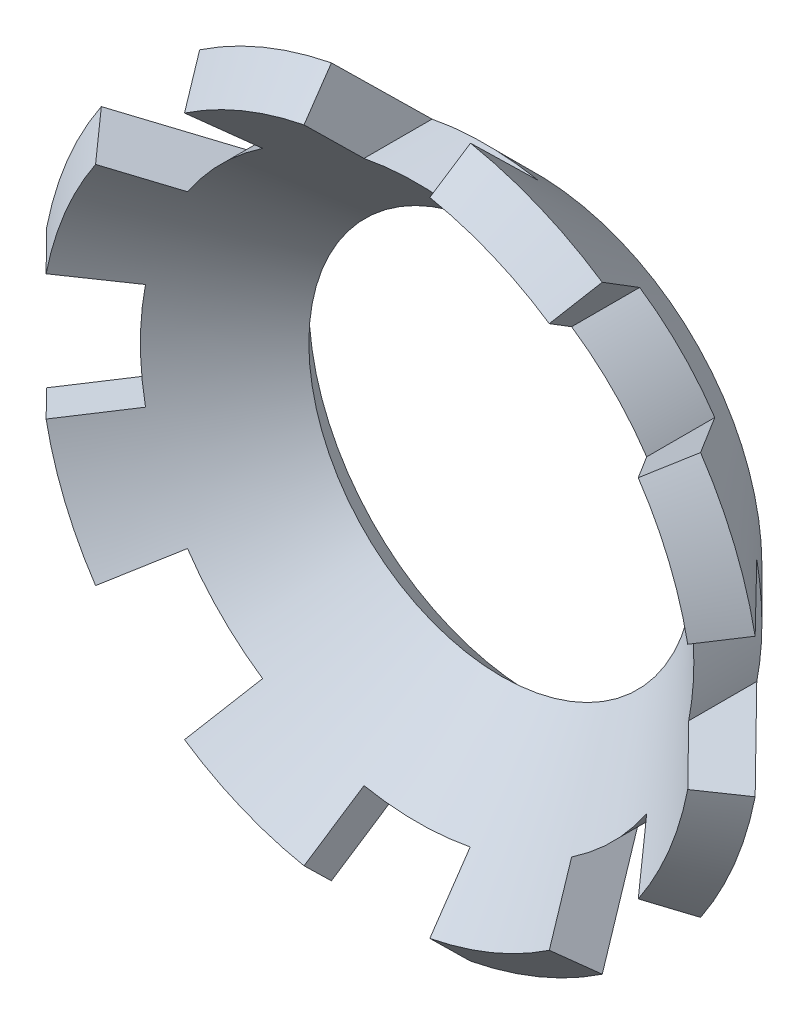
ISO-10303-21;
HEADER;
FILE_DESCRIPTION(('STEP AP214'),'2;1');
FILE_NAME('part.step','',(''),(''),'','','');
FILE_SCHEMA(('AUTOMOTIVE_DESIGN { 1 0 10303 214 1 1 1 1 }'));
ENDSEC;
DATA;
#1=APPLICATION_CONTEXT('core data for automotive mechanical design processes');
#2=APPLICATION_PROTOCOL_DEFINITION('international standard','automotive_design',2000,#1);
#3=PRODUCT_CONTEXT('',#1,'mechanical');
#4=PRODUCT('Part','Part','',(#3));
#5=PRODUCT_RELATED_PRODUCT_CATEGORY('part','',(#4));
#6=PRODUCT_DEFINITION_FORMATION('','',#4);
#7=PRODUCT_DEFINITION_CONTEXT('part definition',#1,'design');
#8=PRODUCT_DEFINITION('design','',#6,#7);
#9=PRODUCT_DEFINITION_SHAPE('','',#8);
#10=(LENGTH_UNIT() NAMED_UNIT(*) SI_UNIT(.MILLI.,.METRE.));
#11=(NAMED_UNIT(*) PLANE_ANGLE_UNIT() SI_UNIT($,.RADIAN.));
#12=(NAMED_UNIT(*) SI_UNIT($,.STERADIAN.) SOLID_ANGLE_UNIT());
#13=UNCERTAINTY_MEASURE_WITH_UNIT(LENGTH_MEASURE(1.E-05),#10,'distance_accuracy_value','');
#14=(GEOMETRIC_REPRESENTATION_CONTEXT(3) GLOBAL_UNCERTAINTY_ASSIGNED_CONTEXT((#13)) GLOBAL_UNIT_ASSIGNED_CONTEXT((#10,
#11,#12)) REPRESENTATION_CONTEXT('',''));
#15=CARTESIAN_POINT('',(0.,0.,0.));
#16=DIRECTION('',(0.,0.,1.));
#17=DIRECTION('',(1.,0.,0.));
#18=AXIS2_PLACEMENT_3D('',#15,#16,#17);
#19=CARTESIAN_POINT('',(0.,0.,0.28284271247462));
#20=DIRECTION('',(0.,0.,-1.));
#21=DIRECTION('',(-1.,0.,0.));
#22=AXIS2_PLACEMENT_3D('',#19,#20,#21);
#23=CONICAL_SURFACE('',#22,2.71715728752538,0.785398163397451);
#24=CARTESIAN_POINT('',(1.67308645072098,2.4903778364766,-0.000199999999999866));
#25=CARTESIAN_POINT('',(1.6468594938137,2.45112642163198,0.0470071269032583));
#26=CARTESIAN_POINT('',(1.6206325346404,2.41187500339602,0.0942142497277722));
#27=CARTESIAN_POINT('',(1.56817861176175,2.33337216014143,0.188628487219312));
#28=CARTESIAN_POINT('',(1.5419516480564,2.29412073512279,0.235835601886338));
#29=CARTESIAN_POINT('',(1.51572468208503,2.25486930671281,0.28304271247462));
#30=B_SPLINE_CURVE_WITH_KNOTS('',3,(#24,#25,#26,#27,#28,#29),.UNSPECIFIED.,.F.,.F.,(4,2,4),(0.,
0.200283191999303,0.400566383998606),.UNSPECIFIED.);
#31=CARTESIAN_POINT('',(1.67297533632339,2.49021154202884,0.));
#32=VERTEX_POINT('',#31);
#33=CARTESIAN_POINT('',(1.51583579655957,2.25503560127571,0.28284271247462));
#34=VERTEX_POINT('',#33);
#35=EDGE_CURVE('E257',#32,#34,#30,.T.);
#36=ORIENTED_EDGE('',*,*,#35,.F.);
#37=CARTESIAN_POINT('',(0.,0.,0.));
#38=DIRECTION('',(0.,0.,1.));
#39=DIRECTION('',(1.,0.,0.));
#40=AXIS2_PLACEMENT_3D('',#37,#38,#39);
#41=CIRCLE('',#40,3.);
#42=CARTESIAN_POINT('',(0.577873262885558,2.9438176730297,0.));
#43=VERTEX_POINT('',#42);
#44=EDGE_CURVE('E64',#32,#43,#41,.T.);
#45=ORIENTED_EDGE('',*,*,#44,.T.);
#46=CARTESIAN_POINT('',(0.522654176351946,2.66621257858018,0.283042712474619));
#47=CARTESIAN_POINT('',(0.531863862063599,2.71251279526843,0.235835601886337));
#48=CARTESIAN_POINT('',(0.541073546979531,2.75881300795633,0.188628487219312));
#49=CARTESIAN_POINT('',(0.559492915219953,2.85141342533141,0.0942142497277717));
#50=CARTESIAN_POINT('',(0.568702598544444,2.89771363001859,0.0470071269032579));
#51=CARTESIAN_POINT('',(0.577912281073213,2.94401383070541,-0.000199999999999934));
#52=B_SPLINE_CURVE_WITH_KNOTS('',3,(#46,#47,#48,#49,#50,#51),.UNSPECIFIED.,.F.,.F.,(4,2,4),(0.,
0.200283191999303,0.400566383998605),.UNSPECIFIED.);
#53=CARTESIAN_POINT('',(0.522693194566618,2.66640873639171,0.28284271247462));
#54=VERTEX_POINT('',#53);
#55=EDGE_CURVE('E470',#54,#43,#52,.T.);
#56=ORIENTED_EDGE('',*,*,#55,.F.);
#57=CARTESIAN_POINT('',(0.,0.,0.28284271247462));
#58=DIRECTION('',(0.,0.,1.));
#59=DIRECTION('',(1.,0.,0.));
#60=AXIS2_PLACEMENT_3D('',#57,#58,#59);
#61=CIRCLE('',#60,2.71715728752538);
#62=EDGE_CURVE('E275',#34,#54,#61,.T.);
#63=ORIENTED_EDGE('',*,*,#62,.F.);
#64=EDGE_LOOP('',(#36,#45,#56,#63));
#65=FACE_BOUND('',#64,.T.);
#66=ADVANCED_FACE('F35',(#65),#23,.T.);
#67=CARTESIAN_POINT('',(-0.577912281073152,2.94401383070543,-0.000200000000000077));
#68=CARTESIAN_POINT('',(-0.568702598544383,2.8977136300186,0.047007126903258));
#69=CARTESIAN_POINT('',(-0.559492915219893,2.85141342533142,0.0942142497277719));
#70=CARTESIAN_POINT('',(-0.541073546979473,2.75881300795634,0.188628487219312));
#71=CARTESIAN_POINT('',(-0.531863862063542,2.71251279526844,0.235835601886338));
#72=CARTESIAN_POINT('',(-0.52265417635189,2.66621257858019,0.283042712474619));
#73=B_SPLINE_CURVE_WITH_KNOTS('',3,(#67,#68,#69,#70,#71,#72),.UNSPECIFIED.,.F.,.F.,(4,2,4),(0.,
0.200283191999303,0.400566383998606),.UNSPECIFIED.);
#74=CARTESIAN_POINT('',(-0.577873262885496,2.94381767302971,0.));
#75=VERTEX_POINT('',#74);
#76=CARTESIAN_POINT('',(-0.522693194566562,2.66640873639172,0.28284271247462));
#77=VERTEX_POINT('',#76);
#78=EDGE_CURVE('E759',#75,#77,#73,.T.);
#79=ORIENTED_EDGE('',*,*,#78,.F.);
#80=CARTESIAN_POINT('',(-1.67297533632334,2.49021154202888,0.));
#81=VERTEX_POINT('',#80);
#82=EDGE_CURVE('E748',#75,#81,#41,.T.);
#83=ORIENTED_EDGE('',*,*,#82,.T.);
#84=CARTESIAN_POINT('',(-1.51572468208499,2.25486930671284,0.28304271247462));
#85=CARTESIAN_POINT('',(-1.54195164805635,2.29412073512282,0.235835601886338));
#86=CARTESIAN_POINT('',(-1.5681786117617,2.33337216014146,0.188628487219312));
#87=CARTESIAN_POINT('',(-1.62063253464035,2.41187500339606,0.0942142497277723));
#88=CARTESIAN_POINT('',(-1.64685949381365,2.45112642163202,0.0470071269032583));
#89=CARTESIAN_POINT('',(-1.67308645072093,2.49037783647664,-0.00019999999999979));
#90=B_SPLINE_CURVE_WITH_KNOTS('',3,(#84,#85,#86,#87,#88,#89),.UNSPECIFIED.,.F.,.F.,(4,2,4),(0.,
0.200283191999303,0.400566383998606),.UNSPECIFIED.);
#91=CARTESIAN_POINT('',(-1.51583579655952,2.25503560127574,0.28284271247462));
#92=VERTEX_POINT('',#91);
#93=EDGE_CURVE('E758',#92,#81,#90,.T.);
#94=ORIENTED_EDGE('',*,*,#93,.F.);
#95=EDGE_CURVE('E280',#77,#92,#61,.T.);
#96=ORIENTED_EDGE('',*,*,#95,.F.);
#97=EDGE_LOOP('',(#79,#83,#94,#96));
#98=FACE_BOUND('',#97,.T.);
#99=ADVANCED_FACE('F756',(#98),#23,.T.);
#100=CARTESIAN_POINT('',(-2.49037783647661,1.67308645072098,-0.000199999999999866));
#101=CARTESIAN_POINT('',(-2.45112642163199,1.64685949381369,0.0470071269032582));
#102=CARTESIAN_POINT('',(-2.41187500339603,1.62063253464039,0.0942142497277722));
#103=CARTESIAN_POINT('',(-2.33337216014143,1.56817861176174,0.188628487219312));
#104=CARTESIAN_POINT('',(-2.29412073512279,1.54195164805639,0.235835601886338));
#105=CARTESIAN_POINT('',(-2.25486930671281,1.51572468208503,0.28304271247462));
#106=B_SPLINE_CURVE_WITH_KNOTS('',3,(#100,#101,#102,#103,#104,#105),.UNSPECIFIED.,.F.,.F.,(4,2,
4),(0.,0.200283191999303,0.400566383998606),.UNSPECIFIED.);
#107=CARTESIAN_POINT('',(-2.49021154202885,1.67297533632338,0.));
#108=VERTEX_POINT('',#107);
#109=CARTESIAN_POINT('',(-2.25503560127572,1.51583579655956,0.28284271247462));
#110=VERTEX_POINT('',#109);
#111=EDGE_CURVE('E506',#108,#110,#106,.T.);
#112=ORIENTED_EDGE('',*,*,#111,.F.);
#113=CARTESIAN_POINT('',(-2.94381767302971,0.577873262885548,0.));
#114=VERTEX_POINT('',#113);
#115=EDGE_CURVE('E744',#108,#114,#41,.T.);
#116=ORIENTED_EDGE('',*,*,#115,.T.);
#117=CARTESIAN_POINT('',(-2.66621257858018,0.522654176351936,0.283042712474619));
#118=CARTESIAN_POINT('',(-2.71251279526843,0.531863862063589,0.235835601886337));
#119=CARTESIAN_POINT('',(-2.75881300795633,0.541073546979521,0.188628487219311));
#120=CARTESIAN_POINT('',(-2.85141342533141,0.559492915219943,0.0942142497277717));
#121=CARTESIAN_POINT('',(-2.89771363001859,0.568702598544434,0.0470071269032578));
#122=CARTESIAN_POINT('',(-2.94401383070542,0.577912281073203,-0.000199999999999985));
#123=B_SPLINE_CURVE_WITH_KNOTS('',3,(#117,#118,#119,#120,#121,#122),.UNSPECIFIED.,.F.,.F.,(4,2,
4),(0.,0.200283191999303,0.400566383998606),.UNSPECIFIED.);
#124=CARTESIAN_POINT('',(-2.66640873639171,0.522693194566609,0.28284271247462));
#125=VERTEX_POINT('',#124);
#126=EDGE_CURVE('E527',#125,#114,#123,.T.);
#127=ORIENTED_EDGE('',*,*,#126,.F.);
#128=EDGE_CURVE('E783',#110,#125,#61,.T.);
#129=ORIENTED_EDGE('',*,*,#128,.F.);
#130=EDGE_LOOP('',(#112,#116,#127,#129));
#131=FACE_BOUND('',#130,.T.);
#132=ADVANCED_FACE('F809',(#131),#23,.T.);
#133=CARTESIAN_POINT('',(-2.94401383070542,-0.577912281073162,-0.000199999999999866));
#134=CARTESIAN_POINT('',(-2.8977136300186,-0.568702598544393,0.047007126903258));
#135=CARTESIAN_POINT('',(-2.85141342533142,-0.559492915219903,0.0942142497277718));
#136=CARTESIAN_POINT('',(-2.75881300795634,-0.541073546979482,0.188628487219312));
#137=CARTESIAN_POINT('',(-2.71251279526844,-0.531863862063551,0.235835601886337));
#138=CARTESIAN_POINT('',(-2.66621257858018,-0.522654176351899,0.283042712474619));
#139=B_SPLINE_CURVE_WITH_KNOTS('',3,(#133,#134,#135,#136,#137,#138),.UNSPECIFIED.,.F.,.F.,(4,2,
4),(0.,0.200283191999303,0.400566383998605),.UNSPECIFIED.);
#140=CARTESIAN_POINT('',(-2.94381767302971,-0.577873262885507,0.));
#141=VERTEX_POINT('',#140);
#142=CARTESIAN_POINT('',(-2.66640873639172,-0.522693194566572,0.28284271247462));
#143=VERTEX_POINT('',#142);
#144=EDGE_CURVE('E1101',#141,#143,#139,.T.);
#145=ORIENTED_EDGE('',*,*,#144,.F.);
#146=CARTESIAN_POINT('',(-2.49021154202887,-1.67297533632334,0.));
#147=VERTEX_POINT('',#146);
#148=EDGE_CURVE('E740',#141,#147,#41,.T.);
#149=ORIENTED_EDGE('',*,*,#148,.T.);
#150=CARTESIAN_POINT('',(-2.25486930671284,-1.51572468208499,0.28304271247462));
#151=CARTESIAN_POINT('',(-2.29412073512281,-1.54195164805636,0.235835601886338));
#152=CARTESIAN_POINT('',(-2.33337216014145,-1.56817861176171,0.188628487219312));
#153=CARTESIAN_POINT('',(-2.41187500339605,-1.62063253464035,0.0942142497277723));
#154=CARTESIAN_POINT('',(-2.45112642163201,-1.64685949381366,0.0470071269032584));
#155=CARTESIAN_POINT('',(-2.49037783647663,-1.67308645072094,-0.000199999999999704));
#156=B_SPLINE_CURVE_WITH_KNOTS('',3,(#150,#151,#152,#153,#154,#155),.UNSPECIFIED.,.F.,.F.,(4,2,
4),(0.,0.200283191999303,0.400566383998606),.UNSPECIFIED.);
#157=CARTESIAN_POINT('',(-2.25503560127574,-1.51583579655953,0.28284271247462));
#158=VERTEX_POINT('',#157);
#159=EDGE_CURVE('E1116',#158,#147,#156,.T.);
#160=ORIENTED_EDGE('',*,*,#159,.F.);
#161=EDGE_CURVE('E784',#143,#158,#61,.T.);
#162=ORIENTED_EDGE('',*,*,#161,.F.);
#163=EDGE_LOOP('',(#145,#149,#160,#162));
#164=FACE_BOUND('',#163,.T.);
#165=ADVANCED_FACE('F803',(#164),#23,.T.);
#166=CARTESIAN_POINT('',(-1.67308645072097,-2.49037783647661,-0.0002));
#167=CARTESIAN_POINT('',(-1.64685949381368,-2.45112642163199,0.047007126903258));
#168=CARTESIAN_POINT('',(-1.62063253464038,-2.41187500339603,0.0942142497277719));
#169=CARTESIAN_POINT('',(-1.56817861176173,-2.33337216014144,0.188628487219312));
#170=CARTESIAN_POINT('',(-1.54195164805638,-2.2941207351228,0.235835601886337));
#171=CARTESIAN_POINT('',(-1.51572468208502,-2.25486930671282,0.283042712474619));
#172=B_SPLINE_CURVE_WITH_KNOTS('',3,(#166,#167,#168,#169,#170,#171),.UNSPECIFIED.,.F.,.F.,(4,2,
4),(0.,0.200283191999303,0.400566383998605),.UNSPECIFIED.);
#173=CARTESIAN_POINT('',(-1.67297533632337,-2.49021154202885,0.));
#174=VERTEX_POINT('',#173);
#175=CARTESIAN_POINT('',(-1.51583579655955,-2.25503560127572,0.28284271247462));
#176=VERTEX_POINT('',#175);
#177=EDGE_CURVE('E564',#174,#176,#172,.T.);
#178=ORIENTED_EDGE('',*,*,#177,.F.);
#179=CARTESIAN_POINT('',(-0.577873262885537,-2.94381767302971,0.));
#180=VERTEX_POINT('',#179);
#181=EDGE_CURVE('E738',#174,#180,#41,.T.);
#182=ORIENTED_EDGE('',*,*,#181,.T.);
#183=CARTESIAN_POINT('',(-0.522654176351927,-2.66621257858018,0.283042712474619));
#184=CARTESIAN_POINT('',(-0.53186386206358,-2.71251279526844,0.235835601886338));
#185=CARTESIAN_POINT('',(-0.541073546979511,-2.75881300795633,0.188628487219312));
#186=CARTESIAN_POINT('',(-0.559492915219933,-2.85141342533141,0.0942142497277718));
#187=CARTESIAN_POINT('',(-0.568702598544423,-2.8977136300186,0.0470071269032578));
#188=CARTESIAN_POINT('',(-0.577912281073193,-2.94401383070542,-0.000200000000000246));
#189=B_SPLINE_CURVE_WITH_KNOTS('',3,(#183,#184,#185,#186,#187,#188),.UNSPECIFIED.,.F.,.F.,(4,2,
4),(0.,0.200283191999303,0.400566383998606),.UNSPECIFIED.);
#190=CARTESIAN_POINT('',(-0.522693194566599,-2.66640873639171,0.28284271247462));
#191=VERTEX_POINT('',#190);
#192=EDGE_CURVE('E585',#191,#180,#189,.T.);
#193=ORIENTED_EDGE('',*,*,#192,.F.);
#194=EDGE_CURVE('E288',#176,#191,#61,.T.);
#195=ORIENTED_EDGE('',*,*,#194,.F.);
#196=EDGE_LOOP('',(#178,#182,#193,#195));
#197=FACE_BOUND('',#196,.T.);
#198=ADVANCED_FACE('F800',(#197),#23,.T.);
#199=CARTESIAN_POINT('',(0.577912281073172,-2.94401383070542,-0.000200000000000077));
#200=CARTESIAN_POINT('',(0.568702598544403,-2.8977136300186,0.047007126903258));
#201=CARTESIAN_POINT('',(0.559492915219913,-2.85141342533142,0.0942142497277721));
#202=CARTESIAN_POINT('',(0.541073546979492,-2.75881300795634,0.188628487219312));
#203=CARTESIAN_POINT('',(0.531863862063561,-2.71251279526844,0.235835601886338));
#204=CARTESIAN_POINT('',(0.522654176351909,-2.66621257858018,0.283042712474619));
#205=B_SPLINE_CURVE_WITH_KNOTS('',3,(#199,#200,#201,#202,#203,#204),.UNSPECIFIED.,.F.,.F.,(4,2,
4),(0.,0.200283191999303,0.400566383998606),.UNSPECIFIED.);
#206=CARTESIAN_POINT('',(0.577873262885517,-2.94381767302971,0.));
#207=VERTEX_POINT('',#206);
#208=CARTESIAN_POINT('',(0.522693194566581,-2.66640873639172,0.28284271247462));
#209=VERTEX_POINT('',#208);
#210=EDGE_CURVE('E799',#207,#209,#205,.T.);
#211=ORIENTED_EDGE('',*,*,#210,.F.);
#212=CARTESIAN_POINT('',(1.67297533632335,-2.49021154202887,0.));
#213=VERTEX_POINT('',#212);
#214=EDGE_CURVE('E737',#207,#213,#41,.T.);
#215=ORIENTED_EDGE('',*,*,#214,.T.);
#216=CARTESIAN_POINT('',(1.515724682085,-2.25486930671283,0.283042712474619));
#217=CARTESIAN_POINT('',(1.54195164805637,-2.29412073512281,0.235835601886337));
#218=CARTESIAN_POINT('',(1.56817861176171,-2.33337216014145,0.188628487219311));
#219=CARTESIAN_POINT('',(1.62063253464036,-2.41187500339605,0.0942142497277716));
#220=CARTESIAN_POINT('',(1.64685949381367,-2.45112642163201,0.0470071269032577));
#221=CARTESIAN_POINT('',(1.67308645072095,-2.49037783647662,-0.000200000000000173));
#222=B_SPLINE_CURVE_WITH_KNOTS('',3,(#216,#217,#218,#219,#220,#221),.UNSPECIFIED.,.F.,.F.,(4,2,
4),(0.,0.200283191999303,0.400566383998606),.UNSPECIFIED.);
#223=CARTESIAN_POINT('',(1.51583579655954,-2.25503560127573,0.28284271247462));
#224=VERTEX_POINT('',#223);
#225=EDGE_CURVE('E728',#224,#213,#222,.T.);
#226=ORIENTED_EDGE('',*,*,#225,.F.);
#227=EDGE_CURVE('E282',#209,#224,#61,.T.);
#228=ORIENTED_EDGE('',*,*,#227,.F.);
#229=EDGE_LOOP('',(#211,#215,#226,#228));
#230=FACE_BOUND('',#229,.T.);
#231=ADVANCED_FACE('F802',(#230),#23,.T.);
#232=CARTESIAN_POINT('',(2.49037783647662,-1.67308645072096,-0.000199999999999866));
#233=CARTESIAN_POINT('',(2.451126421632,-1.64685949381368,0.047007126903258));
#234=CARTESIAN_POINT('',(2.41187500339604,-1.62063253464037,0.094214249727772));
#235=CARTESIAN_POINT('',(2.33337216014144,-1.56817861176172,0.188628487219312));
#236=CARTESIAN_POINT('',(2.2941207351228,-1.54195164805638,0.235835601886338));
#237=CARTESIAN_POINT('',(2.25486930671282,-1.51572468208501,0.28304271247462));
#238=B_SPLINE_CURVE_WITH_KNOTS('',3,(#232,#233,#234,#235,#236,#237),.UNSPECIFIED.,.F.,.F.,(4,2,
4),(0.,0.200283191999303,0.400566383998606),.UNSPECIFIED.);
#239=CARTESIAN_POINT('',(2.49021154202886,-1.67297533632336,0.));
#240=VERTEX_POINT('',#239);
#241=CARTESIAN_POINT('',(2.25503560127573,-1.51583579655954,0.28284271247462));
#242=VERTEX_POINT('',#241);
#243=EDGE_CURVE('E620',#240,#242,#238,.T.);
#244=ORIENTED_EDGE('',*,*,#243,.F.);
#245=CARTESIAN_POINT('',(2.94381767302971,-0.577873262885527,0.));
#246=VERTEX_POINT('',#245);
#247=EDGE_CURVE('E297',#240,#246,#41,.T.);
#248=ORIENTED_EDGE('',*,*,#247,.T.);
#249=CARTESIAN_POINT('',(2.66621257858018,-0.522654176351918,0.283042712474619));
#250=CARTESIAN_POINT('',(2.71251279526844,-0.53186386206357,0.235835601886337));
#251=CARTESIAN_POINT('',(2.75881300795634,-0.541073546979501,0.188628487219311));
#252=CARTESIAN_POINT('',(2.85141342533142,-0.559492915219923,0.0942142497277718));
#253=CARTESIAN_POINT('',(2.8977136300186,-0.568702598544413,0.047007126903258));
#254=CARTESIAN_POINT('',(2.94401383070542,-0.577912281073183,-0.000199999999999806));
#255=B_SPLINE_CURVE_WITH_KNOTS('',3,(#249,#250,#251,#252,#253,#254),.UNSPECIFIED.,.F.,.F.,(4,2,
4),(0.,0.200283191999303,0.400566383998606),.UNSPECIFIED.);
#256=CARTESIAN_POINT('',(2.66640873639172,-0.52269319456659,0.28284271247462));
#257=VERTEX_POINT('',#256);
#258=EDGE_CURVE('E641',#257,#246,#255,.T.);
#259=ORIENTED_EDGE('',*,*,#258,.F.);
#260=EDGE_CURVE('E277',#242,#257,#61,.T.);
#261=ORIENTED_EDGE('',*,*,#260,.F.);
#262=EDGE_LOOP('',(#244,#248,#259,#261));
#263=FACE_BOUND('',#262,.T.);
#264=ADVANCED_FACE('F808',(#263),#23,.T.);
#265=CARTESIAN_POINT('',(2.25486930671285,1.51572468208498,0.28304271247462));
#266=CARTESIAN_POINT('',(2.29412073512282,1.54195164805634,0.235835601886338));
#267=CARTESIAN_POINT('',(2.33337216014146,1.56817861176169,0.188628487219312));
#268=CARTESIAN_POINT('',(2.41187500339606,1.62063253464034,0.0942142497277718));
#269=CARTESIAN_POINT('',(2.45112642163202,1.64685949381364,0.0470071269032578));
#270=CARTESIAN_POINT('',(2.49037783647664,1.67308645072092,-0.000200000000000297));
#271=B_SPLINE_CURVE_WITH_KNOTS('',3,(#265,#266,#267,#268,#269,#270),.UNSPECIFIED.,.F.,.F.,(4,2,
4),(0.,0.200283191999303,0.400566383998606),.UNSPECIFIED.);
#272=CARTESIAN_POINT('',(2.25503560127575,1.51583579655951,0.28284271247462));
#273=VERTEX_POINT('',#272);
#274=CARTESIAN_POINT('',(2.49021154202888,1.67297533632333,0.));
#275=VERTEX_POINT('',#274);
#276=EDGE_CURVE('E56',#273,#275,#271,.T.);
#277=ORIENTED_EDGE('',*,*,#276,.F.);
#278=CARTESIAN_POINT('',(2.66640873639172,0.52269319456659,0.28284271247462));
#279=VERTEX_POINT('',#278);
#280=EDGE_CURVE('E263',#279,#273,#61,.T.);
#281=ORIENTED_EDGE('',*,*,#280,.F.);
#282=CARTESIAN_POINT('',(2.94401383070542,0.577912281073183,-0.000200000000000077));
#283=CARTESIAN_POINT('',(2.8977136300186,0.568702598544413,0.047007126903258));
#284=CARTESIAN_POINT('',(2.85141342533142,0.559492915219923,0.0942142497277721));
#285=CARTESIAN_POINT('',(2.75881300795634,0.541073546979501,0.188628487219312));
#286=CARTESIAN_POINT('',(2.71251279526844,0.53186386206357,0.235835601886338));
#287=CARTESIAN_POINT('',(2.66621257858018,0.522654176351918,0.283042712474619));
#288=B_SPLINE_CURVE_WITH_KNOTS('',3,(#282,#283,#284,#285,#286,#287),.UNSPECIFIED.,.F.,.F.,(4,2,
4),(0.,0.200283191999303,0.400566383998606),.UNSPECIFIED.);
#289=CARTESIAN_POINT('',(2.94381767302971,0.577873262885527,0.));
#290=VERTEX_POINT('',#289);
#291=EDGE_CURVE('E305',#290,#279,#288,.T.);
#292=ORIENTED_EDGE('',*,*,#291,.F.);
#293=EDGE_CURVE('E265',#290,#275,#41,.T.);
#294=ORIENTED_EDGE('',*,*,#293,.T.);
#295=EDGE_LOOP('',(#277,#281,#292,#294));
#296=FACE_BOUND('',#295,.T.);
#297=ADVANCED_FACE('F37',(#296),#23,.T.);
#298=CARTESIAN_POINT('',(0.,0.,-0.834314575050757));
#299=DIRECTION('',(0.,0.,1.));
#300=DIRECTION('',(1.,0.,0.));
#301=AXIS2_PLACEMENT_3D('',#298,#299,#300);
#302=CONICAL_SURFACE('',#301,1.6,0.785398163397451);
#303=CARTESIAN_POINT('',(1.51594691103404,2.25520189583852,0.28304271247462));
#304=CARTESIAN_POINT('',(1.47727926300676,2.19733167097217,0.21344304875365));
#305=CARTESIAN_POINT('',(1.43861160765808,2.13946143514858,0.143843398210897));
#306=CARTESIAN_POINT('',(1.36127628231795,2.02372094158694,0.00464412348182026));
#307=CARTESIAN_POINT('',(1.3226086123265,1.96585068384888,-0.0649555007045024));
#308=CARTESIAN_POINT('',(1.28394093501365,1.90798041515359,-0.134555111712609));
#309=B_SPLINE_CURVE_WITH_KNOTS('',3,(#303,#304,#305,#306,#307,#308),.UNSPECIFIED.,.F.,.F.,(4,2,
4),(0.,0.295286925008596,0.590573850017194),.UNSPECIFIED.);
#310=CARTESIAN_POINT('',(1.28407457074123,1.90818041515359,-0.13431457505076));
#311=VERTEX_POINT('',#310);
#312=EDGE_CURVE('E459',#34,#311,#309,.T.);
#313=ORIENTED_EDGE('',*,*,#312,.F.);
#314=ORIENTED_EDGE('',*,*,#62,.T.);
#315=CARTESIAN_POINT('',(0.441269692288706,2.25706514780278,-0.13451849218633));
#316=CARTESIAN_POINT('',(0.454846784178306,2.32532179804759,-0.0649249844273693));
#317=CARTESIAN_POINT('',(0.468423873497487,2.39357843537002,0.00466853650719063));
#318=CARTESIAN_POINT('',(0.495578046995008,2.53009168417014,0.143855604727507));
#319=CARTESIAN_POINT('',(0.509155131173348,2.59834829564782,0.213449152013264));
#320=CARTESIAN_POINT('',(0.522732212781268,2.66660489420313,0.28304271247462));
#321=B_SPLINE_CURVE_WITH_KNOTS('',3,(#315,#316,#317,#318,#319,#320),.UNSPECIFIED.,.F.,.F.,(4,2,
4),(0.,0.295261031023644,0.590522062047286),.UNSPECIFIED.);
#322=CARTESIAN_POINT('',(0.441309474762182,2.25726514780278,-0.13431457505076));
#323=VERTEX_POINT('',#322);
#324=EDGE_CURVE('E477',#323,#54,#321,.T.);
#325=ORIENTED_EDGE('',*,*,#324,.F.);
#326=CARTESIAN_POINT('',(0.,0.,-0.13431457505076));
#327=DIRECTION('',(0.,0.,1.));
#328=DIRECTION('',(1.,0.,0.));
#329=AXIS2_PLACEMENT_3D('',#326,#327,#328);
#330=CIRCLE('',#329,2.3);
#331=CARTESIAN_POINT('',(-0.441309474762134,2.25726514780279,-0.13431457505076));
#332=VERTEX_POINT('',#331);
#333=EDGE_CURVE('E769',#332,#323,#330,.F.);
#334=ORIENTED_EDGE('',*,*,#333,.F.);
#335=CARTESIAN_POINT('',(-0.522732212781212,2.66660489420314,0.283042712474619));
#336=CARTESIAN_POINT('',(-0.509155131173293,2.59834829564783,0.213449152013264));
#337=CARTESIAN_POINT('',(-0.495578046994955,2.53009168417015,0.143855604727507));
#338=CARTESIAN_POINT('',(-0.468423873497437,2.39357843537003,0.00466853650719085));
#339=CARTESIAN_POINT('',(-0.454846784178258,2.3253217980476,-0.064924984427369));
#340=CARTESIAN_POINT('',(-0.441269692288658,2.25706514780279,-0.13451849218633));
#341=B_SPLINE_CURVE_WITH_KNOTS('',3,(#335,#336,#337,#338,#339,#340),.UNSPECIFIED.,.F.,.F.,(4,2,
4),(0.,0.295261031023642,0.590522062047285),.UNSPECIFIED.);
#342=EDGE_CURVE('E772',#77,#332,#341,.T.);
#343=ORIENTED_EDGE('',*,*,#342,.F.);
#344=ORIENTED_EDGE('',*,*,#95,.T.);
#345=CARTESIAN_POINT('',(-1.28394093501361,1.90798041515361,-0.134555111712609));
#346=CARTESIAN_POINT('',(-1.32260861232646,1.96585068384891,-0.0649555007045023));
#347=CARTESIAN_POINT('',(-1.36127628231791,2.02372094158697,0.00464412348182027));
#348=CARTESIAN_POINT('',(-1.43861160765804,2.13946143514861,0.143843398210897));
#349=CARTESIAN_POINT('',(-1.47727926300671,2.1973316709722,0.21344304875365));
#350=CARTESIAN_POINT('',(-1.51594691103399,2.25520189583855,0.283042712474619));
#351=B_SPLINE_CURVE_WITH_KNOTS('',3,(#345,#346,#347,#348,#349,#350),.UNSPECIFIED.,.F.,.F.,(4,2,
4),(0.,0.295286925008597,0.590573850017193),.UNSPECIFIED.);
#352=CARTESIAN_POINT('',(-1.28407457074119,1.90818041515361,-0.13431457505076));
#353=VERTEX_POINT('',#352);
#354=EDGE_CURVE('E512',#353,#92,#351,.T.);
#355=ORIENTED_EDGE('',*,*,#354,.F.);
#356=CARTESIAN_POINT('',(0.,0.,-0.13431457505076));
#357=DIRECTION('',(0.,0.,1.));
#358=DIRECTION('',(1.,0.,0.));
#359=AXIS2_PLACEMENT_3D('',#356,#357,#358);
#360=CIRCLE('',#359,2.3);
#361=CARTESIAN_POINT('',(-1.90818041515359,1.28407457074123,-0.13431457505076));
#362=VERTEX_POINT('',#361);
#363=EDGE_CURVE('E521',#362,#353,#360,.F.);
#364=ORIENTED_EDGE('',*,*,#363,.F.);
#365=CARTESIAN_POINT('',(-2.25520189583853,1.51594691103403,0.28304271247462));
#366=CARTESIAN_POINT('',(-2.19733167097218,1.47727926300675,0.21344304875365));
#367=CARTESIAN_POINT('',(-2.13946143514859,1.43861160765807,0.143843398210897));
#368=CARTESIAN_POINT('',(-2.02372094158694,1.36127628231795,0.00464412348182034));
#369=CARTESIAN_POINT('',(-1.96585068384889,1.32260861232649,-0.0649555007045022));
#370=CARTESIAN_POINT('',(-1.90798041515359,1.28394093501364,-0.134555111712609));
#371=B_SPLINE_CURVE_WITH_KNOTS('',3,(#365,#366,#367,#368,#369,#370),.UNSPECIFIED.,.F.,.F.,(4,2,
4),(0.,0.295286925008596,0.590573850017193),.UNSPECIFIED.);
#372=EDGE_CURVE('E511',#110,#362,#371,.T.);
#373=ORIENTED_EDGE('',*,*,#372,.F.);
#374=ORIENTED_EDGE('',*,*,#128,.T.);
#375=CARTESIAN_POINT('',(-2.25706514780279,0.441269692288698,-0.134518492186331));
#376=CARTESIAN_POINT('',(-2.32532179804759,0.454846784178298,-0.0649249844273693));
#377=CARTESIAN_POINT('',(-2.39357843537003,0.468423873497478,0.0046685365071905));
#378=CARTESIAN_POINT('',(-2.53009168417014,0.495578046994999,0.143855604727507));
#379=CARTESIAN_POINT('',(-2.59834829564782,0.509155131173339,0.213449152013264));
#380=CARTESIAN_POINT('',(-2.66660489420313,0.522732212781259,0.283042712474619));
#381=B_SPLINE_CURVE_WITH_KNOTS('',3,(#375,#376,#377,#378,#379,#380),.UNSPECIFIED.,.F.,.F.,(4,2,
4),(0.,0.295261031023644,0.590522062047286),.UNSPECIFIED.);
#382=CARTESIAN_POINT('',(-2.25726514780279,0.441309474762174,-0.13431457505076));
#383=VERTEX_POINT('',#382);
#384=EDGE_CURVE('E535',#383,#125,#381,.T.);
#385=ORIENTED_EDGE('',*,*,#384,.F.);
#386=CARTESIAN_POINT('',(0.,0.,-0.13431457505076));
#387=DIRECTION('',(0.,0.,1.));
#388=DIRECTION('',(1.,0.,0.));
#389=AXIS2_PLACEMENT_3D('',#386,#387,#388);
#390=CIRCLE('',#389,2.3);
#391=CARTESIAN_POINT('',(-2.25726514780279,-0.441309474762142,-0.13431457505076));
#392=VERTEX_POINT('',#391);
#393=EDGE_CURVE('E1103',#392,#383,#390,.F.);
#394=ORIENTED_EDGE('',*,*,#393,.F.);
#395=CARTESIAN_POINT('',(-2.66660489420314,-0.522732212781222,0.28304271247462));
#396=CARTESIAN_POINT('',(-2.59834829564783,-0.509155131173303,0.213449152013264));
#397=CARTESIAN_POINT('',(-2.53009168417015,-0.495578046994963,0.143855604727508));
#398=CARTESIAN_POINT('',(-2.39357843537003,-0.468423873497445,0.00466853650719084));
#399=CARTESIAN_POINT('',(-2.3253217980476,-0.454846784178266,-0.064924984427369));
#400=CARTESIAN_POINT('',(-2.25706514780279,-0.441269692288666,-0.13451849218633));
#401=B_SPLINE_CURVE_WITH_KNOTS('',3,(#395,#396,#397,#398,#399,#400),.UNSPECIFIED.,.F.,.F.,(4,2,
4),(0.,0.295261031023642,0.590522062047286),.UNSPECIFIED.);
#402=EDGE_CURVE('E1102',#143,#392,#401,.T.);
#403=ORIENTED_EDGE('',*,*,#402,.F.);
#404=ORIENTED_EDGE('',*,*,#161,.T.);
#405=CARTESIAN_POINT('',(-1.90798041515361,-1.28394093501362,-0.134555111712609));
#406=CARTESIAN_POINT('',(-1.9658506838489,-1.32260861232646,-0.0649555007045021));
#407=CARTESIAN_POINT('',(-2.02372094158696,-1.36127628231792,0.00464412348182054));
#408=CARTESIAN_POINT('',(-2.13946143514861,-1.43861160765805,0.143843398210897));
#409=CARTESIAN_POINT('',(-2.1973316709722,-1.47727926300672,0.21344304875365));
#410=CARTESIAN_POINT('',(-2.25520189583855,-1.515946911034,0.283042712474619));
#411=B_SPLINE_CURVE_WITH_KNOTS('',3,(#405,#406,#407,#408,#409,#410),.UNSPECIFIED.,.F.,.F.,(4,2,
4),(0.,0.295286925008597,0.590573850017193),.UNSPECIFIED.);
#412=CARTESIAN_POINT('',(-1.90818041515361,-1.2840745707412,-0.13431457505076));
#413=VERTEX_POINT('',#412);
#414=EDGE_CURVE('E570',#413,#158,#411,.T.);
#415=ORIENTED_EDGE('',*,*,#414,.F.);
#416=CARTESIAN_POINT('',(0.,0.,-0.13431457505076));
#417=DIRECTION('',(0.,0.,1.));
#418=DIRECTION('',(1.,0.,0.));
#419=AXIS2_PLACEMENT_3D('',#416,#417,#418);
#420=CIRCLE('',#419,2.3);
#421=CARTESIAN_POINT('',(-1.28407457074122,-1.9081804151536,-0.13431457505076));
#422=VERTEX_POINT('',#421);
#423=EDGE_CURVE('E579',#422,#413,#420,.F.);
#424=ORIENTED_EDGE('',*,*,#423,.F.);
#425=CARTESIAN_POINT('',(-1.51594691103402,-2.25520189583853,0.28304271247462));
#426=CARTESIAN_POINT('',(-1.47727926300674,-2.19733167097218,0.21344304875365));
#427=CARTESIAN_POINT('',(-1.43861160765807,-2.13946143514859,0.143843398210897));
#428=CARTESIAN_POINT('',(-1.36127628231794,-2.02372094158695,0.00464412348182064));
#429=CARTESIAN_POINT('',(-1.32260861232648,-1.96585068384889,-0.0649555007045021));
#430=CARTESIAN_POINT('',(-1.28394093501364,-1.9079804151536,-0.134555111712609));
#431=B_SPLINE_CURVE_WITH_KNOTS('',3,(#425,#426,#427,#428,#429,#430),.UNSPECIFIED.,.F.,.F.,(4,2,
4),(0.,0.295286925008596,0.590573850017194),.UNSPECIFIED.);
#432=EDGE_CURVE('E569',#176,#422,#431,.T.);
#433=ORIENTED_EDGE('',*,*,#432,.F.);
#434=ORIENTED_EDGE('',*,*,#194,.T.);
#435=CARTESIAN_POINT('',(-0.44126969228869,-2.25706514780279,-0.13451849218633));
#436=CARTESIAN_POINT('',(-0.45484678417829,-2.32532179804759,-0.064924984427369));
#437=CARTESIAN_POINT('',(-0.46842387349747,-2.39357843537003,0.00466853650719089));
#438=CARTESIAN_POINT('',(-0.49557804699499,-2.53009168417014,0.143855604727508));
#439=CARTESIAN_POINT('',(-0.50915513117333,-2.59834829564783,0.213449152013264));
#440=CARTESIAN_POINT('',(-0.522732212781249,-2.66660489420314,0.28304271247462));
#441=B_SPLINE_CURVE_WITH_KNOTS('',3,(#435,#436,#437,#438,#439,#440),.UNSPECIFIED.,.F.,.F.,(4,2,
4),(0.,0.295261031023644,0.590522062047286),.UNSPECIFIED.);
#442=CARTESIAN_POINT('',(-0.441309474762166,-2.25726514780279,-0.13431457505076));
#443=VERTEX_POINT('',#442);
#444=EDGE_CURVE('E593',#443,#191,#441,.T.);
#445=ORIENTED_EDGE('',*,*,#444,.F.);
#446=CARTESIAN_POINT('',(0.,0.,-0.13431457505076));
#447=DIRECTION('',(0.,0.,1.));
#448=DIRECTION('',(1.,0.,0.));
#449=AXIS2_PLACEMENT_3D('',#446,#447,#448);
#450=CIRCLE('',#449,2.3);
#451=CARTESIAN_POINT('',(0.44130947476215,-2.25726514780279,-0.13431457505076));
#452=VERTEX_POINT('',#451);
#453=EDGE_CURVE('E732',#452,#443,#450,.F.);
#454=ORIENTED_EDGE('',*,*,#453,.F.);
#455=CARTESIAN_POINT('',(0.522732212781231,-2.66660489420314,0.28304271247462));
#456=CARTESIAN_POINT('',(0.509155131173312,-2.59834829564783,0.213449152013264));
#457=CARTESIAN_POINT('',(0.495578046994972,-2.53009168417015,0.143855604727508));
#458=CARTESIAN_POINT('',(0.468423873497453,-2.39357843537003,0.00466853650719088));
#459=CARTESIAN_POINT('',(0.454846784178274,-2.3253217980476,-0.064924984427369));
#460=CARTESIAN_POINT('',(0.441269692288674,-2.25706514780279,-0.13451849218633));
#461=B_SPLINE_CURVE_WITH_KNOTS('',3,(#455,#456,#457,#458,#459,#460),.UNSPECIFIED.,.F.,.F.,(4,2,
4),(0.,0.295261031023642,0.590522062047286),.UNSPECIFIED.);
#462=EDGE_CURVE('E829',#209,#452,#461,.T.);
#463=ORIENTED_EDGE('',*,*,#462,.F.);
#464=ORIENTED_EDGE('',*,*,#227,.T.);
#465=CARTESIAN_POINT('',(1.28394093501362,-1.9079804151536,-0.134555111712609));
#466=CARTESIAN_POINT('',(1.32260861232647,-1.9658506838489,-0.0649555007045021));
#467=CARTESIAN_POINT('',(1.36127628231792,-2.02372094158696,0.0046441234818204));
#468=CARTESIAN_POINT('',(1.43861160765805,-2.1394614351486,0.143843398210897));
#469=CARTESIAN_POINT('',(1.47727926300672,-2.19733167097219,0.21344304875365));
#470=CARTESIAN_POINT('',(1.51594691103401,-2.25520189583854,0.283042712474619));
#471=B_SPLINE_CURVE_WITH_KNOTS('',3,(#465,#466,#467,#468,#469,#470),.UNSPECIFIED.,.F.,.F.,(4,2,
4),(0.,0.295286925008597,0.590573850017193),.UNSPECIFIED.);
#472=CARTESIAN_POINT('',(1.28407457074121,-1.9081804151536,-0.13431457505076));
#473=VERTEX_POINT('',#472);
#474=EDGE_CURVE('E626',#473,#224,#471,.T.);
#475=ORIENTED_EDGE('',*,*,#474,.F.);
#476=CARTESIAN_POINT('',(0.,0.,-0.13431457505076));
#477=DIRECTION('',(0.,0.,1.));
#478=DIRECTION('',(1.,0.,0.));
#479=AXIS2_PLACEMENT_3D('',#476,#477,#478);
#480=CIRCLE('',#479,2.3);
#481=CARTESIAN_POINT('',(1.9081804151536,-1.28407457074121,-0.13431457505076));
#482=VERTEX_POINT('',#481);
#483=EDGE_CURVE('E635',#482,#473,#480,.F.);
#484=ORIENTED_EDGE('',*,*,#483,.F.);
#485=CARTESIAN_POINT('',(2.25520189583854,-1.51594691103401,0.28304271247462));
#486=CARTESIAN_POINT('',(2.19733167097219,-1.47727926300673,0.21344304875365));
#487=CARTESIAN_POINT('',(2.1394614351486,-1.43861160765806,0.143843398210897));
#488=CARTESIAN_POINT('',(2.02372094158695,-1.36127628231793,0.00464412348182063));
#489=CARTESIAN_POINT('',(1.96585068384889,-1.32260861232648,-0.0649555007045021));
#490=CARTESIAN_POINT('',(1.9079804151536,-1.28394093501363,-0.134555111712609));
#491=B_SPLINE_CURVE_WITH_KNOTS('',3,(#485,#486,#487,#488,#489,#490),.UNSPECIFIED.,.F.,.F.,(4,2,
4),(0.,0.295286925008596,0.590573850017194),.UNSPECIFIED.);
#492=EDGE_CURVE('E625',#242,#482,#491,.T.);
#493=ORIENTED_EDGE('',*,*,#492,.F.);
#494=ORIENTED_EDGE('',*,*,#260,.T.);
#495=CARTESIAN_POINT('',(2.25706514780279,-0.441269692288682,-0.13451849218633));
#496=CARTESIAN_POINT('',(2.3253217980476,-0.454846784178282,-0.064924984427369));
#497=CARTESIAN_POINT('',(2.39357843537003,-0.468423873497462,0.00466853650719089));
#498=CARTESIAN_POINT('',(2.53009168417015,-0.495578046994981,0.143855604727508));
#499=CARTESIAN_POINT('',(2.59834829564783,-0.509155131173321,0.213449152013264));
#500=CARTESIAN_POINT('',(2.66660489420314,-0.52273221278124,0.28304271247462));
#501=B_SPLINE_CURVE_WITH_KNOTS('',3,(#495,#496,#497,#498,#499,#500),.UNSPECIFIED.,.F.,.F.,(4,2,
4),(0.,0.295261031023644,0.590522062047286),.UNSPECIFIED.);
#502=CARTESIAN_POINT('',(2.25726514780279,-0.441309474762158,-0.13431457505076));
#503=VERTEX_POINT('',#502);
#504=EDGE_CURVE('E648',#503,#257,#501,.T.);
#505=ORIENTED_EDGE('',*,*,#504,.F.);
#506=CARTESIAN_POINT('',(0.,0.,-0.13431457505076));
#507=DIRECTION('',(0.,0.,1.));
#508=DIRECTION('',(1.,0.,0.));
#509=AXIS2_PLACEMENT_3D('',#506,#507,#508);
#510=CIRCLE('',#509,2.3);
#511=CARTESIAN_POINT('',(2.25726514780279,0.441309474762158,-0.13431457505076));
#512=VERTEX_POINT('',#511);
#513=EDGE_CURVE('E298',#512,#503,#510,.F.);
#514=ORIENTED_EDGE('',*,*,#513,.F.);
#515=CARTESIAN_POINT('',(2.66660489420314,0.52273221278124,0.28304271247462));
#516=CARTESIAN_POINT('',(2.59834829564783,0.509155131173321,0.213449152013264));
#517=CARTESIAN_POINT('',(2.53009168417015,0.495578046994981,0.143855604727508));
#518=CARTESIAN_POINT('',(2.39357843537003,0.468423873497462,0.00466853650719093));
#519=CARTESIAN_POINT('',(2.3253217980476,0.454846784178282,-0.064924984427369));
#520=CARTESIAN_POINT('',(2.25706514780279,0.441269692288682,-0.13451849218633));
#521=B_SPLINE_CURVE_WITH_KNOTS('',3,(#515,#516,#517,#518,#519,#520),.UNSPECIFIED.,.F.,.F.,(4,2,
4),(0.,0.295261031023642,0.590522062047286),.UNSPECIFIED.);
#522=EDGE_CURVE('E273',#279,#512,#521,.T.);
#523=ORIENTED_EDGE('',*,*,#522,.F.);
#524=ORIENTED_EDGE('',*,*,#280,.T.);
#525=CARTESIAN_POINT('',(1.90798041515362,1.2839409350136,-0.134555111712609));
#526=CARTESIAN_POINT('',(1.96585068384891,1.32260861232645,-0.0649555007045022));
#527=CARTESIAN_POINT('',(2.02372094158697,1.3612762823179,0.00464412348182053));
#528=CARTESIAN_POINT('',(2.13946143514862,1.43861160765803,0.143843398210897));
#529=CARTESIAN_POINT('',(2.19733167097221,1.4772792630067,0.21344304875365));
#530=CARTESIAN_POINT('',(2.25520189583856,1.51594691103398,0.28304271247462));
#531=B_SPLINE_CURVE_WITH_KNOTS('',3,(#525,#526,#527,#528,#529,#530),.UNSPECIFIED.,.F.,.F.,(4,2,
4),(0.,0.295286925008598,0.590573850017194),.UNSPECIFIED.);
#532=CARTESIAN_POINT('',(1.90818041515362,1.28407457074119,-0.13431457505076));
#533=VERTEX_POINT('',#532);
#534=EDGE_CURVE('E250',#533,#273,#531,.T.);
#535=ORIENTED_EDGE('',*,*,#534,.F.);
#536=CARTESIAN_POINT('',(0.,0.,-0.13431457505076));
#537=DIRECTION('',(0.,0.,1.));
#538=DIRECTION('',(1.,0.,0.));
#539=AXIS2_PLACEMENT_3D('',#536,#537,#538);
#540=CIRCLE('',#539,2.3);
#541=EDGE_CURVE('E464',#311,#533,#540,.F.);
#542=ORIENTED_EDGE('',*,*,#541,.F.);
#543=EDGE_LOOP('',(#313,#314,#325,#334,#343,#344,#355,#364,#373,#374,#385,#394,#403,#404,#415,
#424,#433,#434,#445,#454,#463,#464,#475,#484,#493,#494,#505,#514,#523,#524,#535,#542));
#544=FACE_BOUND('',#543,.T.);
#545=CARTESIAN_POINT('',(0.,0.,-0.834314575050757));
#546=DIRECTION('',(0.,0.,1.));
#547=DIRECTION('',(1.,0.,0.));
#548=AXIS2_PLACEMENT_3D('',#545,#546,#547);
#549=CIRCLE('',#548,1.6);
#550=CARTESIAN_POINT('',(1.6,0.,-0.834314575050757));
#551=VERTEX_POINT('',#550);
#552=EDGE_CURVE('E283',#551,#551,#549,.T.);
#553=ORIENTED_EDGE('',*,*,#552,.F.);
#554=EDGE_LOOP('',(#553));
#555=FACE_BOUND('',#554,.T.);
#556=ADVANCED_FACE('F270',(#544,#555),#302,.F.);
#557=CARTESIAN_POINT('',(0.,0.,-1.11715728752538));
#558=DIRECTION('',(0.,0.,-1.));
#559=DIRECTION('',(-1.,0.,0.));
#560=AXIS2_PLACEMENT_3D('',#557,#558,#559);
#561=CONICAL_SURFACE('',#560,1.88284271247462,0.785398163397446);
#562=ORIENTED_EDGE('',*,*,#552,.T.);
#563=EDGE_LOOP('',(#562));
#564=FACE_BOUND('',#563,.T.);
#565=CARTESIAN_POINT('',(0.,0.,-1.11715728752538));
#566=DIRECTION('',(0.,0.,1.));
#567=DIRECTION('',(1.,0.,0.));
#568=AXIS2_PLACEMENT_3D('',#565,#566,#567);
#569=CIRCLE('',#568,1.88284271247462);
#570=CARTESIAN_POINT('',(1.88284271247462,0.,-1.11715728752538));
#571=VERTEX_POINT('',#570);
#572=EDGE_CURVE('E290',#571,#571,#569,.T.);
#573=ORIENTED_EDGE('',*,*,#572,.F.);
#574=EDGE_LOOP('',(#573));
#575=FACE_BOUND('',#574,.T.);
#576=ADVANCED_FACE('F341',(#564,#575),#561,.F.);
#577=CARTESIAN_POINT('',(0.,0.,0.));
#578=DIRECTION('',(0.,0.,1.));
#579=DIRECTION('',(1.,0.,0.));
#580=AXIS2_PLACEMENT_3D('',#577,#578,#579);
#581=CONICAL_SURFACE('',#580,3.,0.785398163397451);
#582=CARTESIAN_POINT('',(1.28394093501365,1.90798041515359,-0.700240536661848));
#583=CARTESIAN_POINT('',(1.34879855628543,2.00504670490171,-0.583500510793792));
#584=CARTESIAN_POINT('',(1.41365615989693,2.10211296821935,-0.466760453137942));
#585=CARTESIAN_POINT('',(1.54337133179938,2.29624544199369,-0.233280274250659));
#586=CARTESIAN_POINT('',(1.60822890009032,2.39331165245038,-0.116540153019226));
#587=CARTESIAN_POINT('',(1.67308645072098,2.4903778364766,0.000199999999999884));
#588=B_SPLINE_CURVE_WITH_KNOTS('',3,(#582,#583,#584,#585,#586,#587),.UNSPECIFIED.,.F.,.F.,(4,2,
4),(0.,0.495287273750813,0.990574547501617),.UNSPECIFIED.);
#589=CARTESIAN_POINT('',(1.28407457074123,1.90818041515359,-0.699999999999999));
#590=VERTEX_POINT('',#589);
#591=EDGE_CURVE('E11',#590,#32,#588,.T.);
#592=ORIENTED_EDGE('',*,*,#591,.F.);
#593=CARTESIAN_POINT('',(0.,0.,-0.699999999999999));
#594=DIRECTION('',(0.,0.,1.));
#595=DIRECTION('',(1.,0.,0.));
#596=AXIS2_PLACEMENT_3D('',#593,#594,#595);
#597=CIRCLE('',#596,2.3);
#598=CARTESIAN_POINT('',(1.90818041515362,1.28407457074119,-0.699999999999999));
#599=VERTEX_POINT('',#598);
#600=EDGE_CURVE('E49',#599,#590,#597,.T.);
#601=ORIENTED_EDGE('',*,*,#600,.F.);
#602=CARTESIAN_POINT('',(2.49037783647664,1.67308645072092,0.000199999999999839));
#603=CARTESIAN_POINT('',(2.39331165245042,1.60822890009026,-0.116540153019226));
#604=CARTESIAN_POINT('',(2.29624544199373,1.54337133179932,-0.23328027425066));
#605=CARTESIAN_POINT('',(2.10211296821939,1.41365615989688,-0.466760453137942));
#606=CARTESIAN_POINT('',(2.00504670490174,1.34879855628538,-0.583500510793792));
#607=CARTESIAN_POINT('',(1.90798041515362,1.2839409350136,-0.700240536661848));
#608=B_SPLINE_CURVE_WITH_KNOTS('',3,(#602,#603,#604,#605,#606,#607),.UNSPECIFIED.,.F.,.F.,(4,2,
4),(0.,0.495287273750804,0.990574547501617),.UNSPECIFIED.);
#609=EDGE_CURVE('E433',#275,#599,#608,.T.);
#610=ORIENTED_EDGE('',*,*,#609,.F.);
#611=ORIENTED_EDGE('',*,*,#293,.F.);
#612=CARTESIAN_POINT('',(2.25706514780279,0.441269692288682,-0.700203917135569));
#613=CARTESIAN_POINT('',(2.37155665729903,0.464043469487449,-0.583469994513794));
#614=CARTESIAN_POINT('',(2.48604813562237,0.486817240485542,-0.466736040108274));
#615=CARTESIAN_POINT('',(2.71503102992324,0.532364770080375,-0.233268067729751));
#616=CARTESIAN_POINT('',(2.82952244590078,0.555138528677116,-0.116534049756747));
#617=CARTESIAN_POINT('',(2.94401383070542,0.577912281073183,0.000200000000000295));
#618=B_SPLINE_CURVE_WITH_KNOTS('',3,(#612,#613,#614,#615,#616,#617),.UNSPECIFIED.,.F.,.F.,(4,2,
4),(0.,0.49526137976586,0.990522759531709),.UNSPECIFIED.);
#619=CARTESIAN_POINT('',(2.25726514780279,0.441309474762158,-0.699999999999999));
#620=VERTEX_POINT('',#619);
#621=EDGE_CURVE('E327',#620,#290,#618,.T.);
#622=ORIENTED_EDGE('',*,*,#621,.F.);
#623=CARTESIAN_POINT('',(0.,0.,-0.699999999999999));
#624=DIRECTION('',(0.,0.,1.));
#625=DIRECTION('',(1.,0.,0.));
#626=AXIS2_PLACEMENT_3D('',#623,#624,#625);
#627=CIRCLE('',#626,2.3);
#628=CARTESIAN_POINT('',(2.25726514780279,-0.441309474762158,-0.699999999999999));
#629=VERTEX_POINT('',#628);
#630=EDGE_CURVE('E278',#629,#620,#627,.T.);
#631=ORIENTED_EDGE('',*,*,#630,.F.);
#632=CARTESIAN_POINT('',(2.94401383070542,-0.577912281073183,0.000200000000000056));
#633=CARTESIAN_POINT('',(2.82952244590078,-0.555138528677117,-0.116534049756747));
#634=CARTESIAN_POINT('',(2.71503102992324,-0.532364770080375,-0.233268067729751));
#635=CARTESIAN_POINT('',(2.48604813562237,-0.486817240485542,-0.466736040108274));
#636=CARTESIAN_POINT('',(2.37155665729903,-0.464043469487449,-0.583469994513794));
#637=CARTESIAN_POINT('',(2.25706514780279,-0.441269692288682,-0.700203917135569));
#638=B_SPLINE_CURVE_WITH_KNOTS('',3,(#632,#633,#634,#635,#636,#637),.UNSPECIFIED.,.F.,.F.,(4,2,
4),(0.,0.49526137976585,0.99052275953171),.UNSPECIFIED.);
#639=EDGE_CURVE('E274',#246,#629,#638,.T.);
#640=ORIENTED_EDGE('',*,*,#639,.F.);
#641=ORIENTED_EDGE('',*,*,#247,.F.);
#642=CARTESIAN_POINT('',(1.9079804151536,-1.28394093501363,-0.700240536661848));
#643=CARTESIAN_POINT('',(2.00504670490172,-1.34879855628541,-0.583500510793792));
#644=CARTESIAN_POINT('',(2.10211296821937,-1.41365615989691,-0.466760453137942));
#645=CARTESIAN_POINT('',(2.2962454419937,-1.54337133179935,-0.233280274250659));
#646=CARTESIAN_POINT('',(2.3933116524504,-1.6082289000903,-0.116540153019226));
#647=CARTESIAN_POINT('',(2.49037783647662,-1.67308645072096,0.000199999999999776));
#648=B_SPLINE_CURVE_WITH_KNOTS('',3,(#642,#643,#644,#645,#646,#647),.UNSPECIFIED.,.F.,.F.,(4,2,
4),(0.,0.495287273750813,0.990574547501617),.UNSPECIFIED.);
#649=CARTESIAN_POINT('',(1.9081804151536,-1.28407457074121,-0.699999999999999));
#650=VERTEX_POINT('',#649);
#651=EDGE_CURVE('E353',#650,#240,#648,.T.);
#652=ORIENTED_EDGE('',*,*,#651,.F.);
#653=CARTESIAN_POINT('',(0.,0.,-0.699999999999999));
#654=DIRECTION('',(0.,0.,1.));
#655=DIRECTION('',(1.,0.,0.));
#656=AXIS2_PLACEMENT_3D('',#653,#654,#655);
#657=CIRCLE('',#656,2.3);
#658=CARTESIAN_POINT('',(1.28407457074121,-1.9081804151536,-0.699999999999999));
#659=VERTEX_POINT('',#658);
#660=EDGE_CURVE('E712',#659,#650,#657,.T.);
#661=ORIENTED_EDGE('',*,*,#660,.F.);
#662=CARTESIAN_POINT('',(1.67308645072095,-2.49037783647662,0.000199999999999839));
#663=CARTESIAN_POINT('',(1.60822890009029,-2.39331165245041,-0.116540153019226));
#664=CARTESIAN_POINT('',(1.54337133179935,-2.29624544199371,-0.233280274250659));
#665=CARTESIAN_POINT('',(1.4136561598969,-2.10211296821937,-0.466760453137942));
#666=CARTESIAN_POINT('',(1.3487985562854,-2.00504670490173,-0.583500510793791));
#667=CARTESIAN_POINT('',(1.28394093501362,-1.9079804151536,-0.700240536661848));
#668=B_SPLINE_CURVE_WITH_KNOTS('',3,(#662,#663,#664,#665,#666,#667),.UNSPECIFIED.,.F.,.F.,(4,2,
4),(0.,0.495287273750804,0.990574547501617),.UNSPECIFIED.);
#669=EDGE_CURVE('E333',#213,#659,#668,.T.);
#670=ORIENTED_EDGE('',*,*,#669,.F.);
#671=ORIENTED_EDGE('',*,*,#214,.F.);
#672=CARTESIAN_POINT('',(0.441269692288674,-2.25706514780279,-0.700203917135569));
#673=CARTESIAN_POINT('',(0.464043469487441,-2.37155665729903,-0.583469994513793));
#674=CARTESIAN_POINT('',(0.486817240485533,-2.48604813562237,-0.466736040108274));
#675=CARTESIAN_POINT('',(0.532364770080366,-2.71503102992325,-0.233268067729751));
#676=CARTESIAN_POINT('',(0.555138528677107,-2.82952244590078,-0.116534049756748));
#677=CARTESIAN_POINT('',(0.577912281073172,-2.94401383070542,0.000199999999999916));
#678=B_SPLINE_CURVE_WITH_KNOTS('',3,(#672,#673,#674,#675,#676,#677),.UNSPECIFIED.,.F.,.F.,(4,2,
4),(0.,0.495261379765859,0.990522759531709),.UNSPECIFIED.);
#679=CARTESIAN_POINT('',(0.44130947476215,-2.25726514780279,-0.699999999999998));
#680=VERTEX_POINT('',#679);
#681=EDGE_CURVE('E368',#680,#207,#678,.T.);
#682=ORIENTED_EDGE('',*,*,#681,.F.);
#683=CARTESIAN_POINT('',(0.,0.,-0.699999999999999));
#684=DIRECTION('',(0.,0.,1.));
#685=DIRECTION('',(1.,0.,0.));
#686=AXIS2_PLACEMENT_3D('',#683,#684,#685);
#687=CIRCLE('',#686,2.3);
#688=CARTESIAN_POINT('',(-0.441309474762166,-2.25726514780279,-0.699999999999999));
#689=VERTEX_POINT('',#688);
#690=EDGE_CURVE('E704',#689,#680,#687,.T.);
#691=ORIENTED_EDGE('',*,*,#690,.F.);
#692=CARTESIAN_POINT('',(-0.577912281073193,-2.94401383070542,0.000200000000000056));
#693=CARTESIAN_POINT('',(-0.555138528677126,-2.82952244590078,-0.116534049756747));
#694=CARTESIAN_POINT('',(-0.532364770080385,-2.71503102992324,-0.233268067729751));
#695=CARTESIAN_POINT('',(-0.48681724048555,-2.48604813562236,-0.466736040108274));
#696=CARTESIAN_POINT('',(-0.464043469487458,-2.37155665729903,-0.583469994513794));
#697=CARTESIAN_POINT('',(-0.44126969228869,-2.25706514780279,-0.700203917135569));
#698=B_SPLINE_CURVE_WITH_KNOTS('',3,(#692,#693,#694,#695,#696,#697),.UNSPECIFIED.,.F.,.F.,(4,2,
4),(0.,0.49526137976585,0.99052275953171),.UNSPECIFIED.);
#699=EDGE_CURVE('E360',#180,#689,#698,.T.);
#700=ORIENTED_EDGE('',*,*,#699,.F.);
#701=ORIENTED_EDGE('',*,*,#181,.F.);
#702=CARTESIAN_POINT('',(-1.28394093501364,-1.9079804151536,-0.700240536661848));
#703=CARTESIAN_POINT('',(-1.34879855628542,-2.00504670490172,-0.583500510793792));
#704=CARTESIAN_POINT('',(-1.41365615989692,-2.10211296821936,-0.466760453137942));
#705=CARTESIAN_POINT('',(-1.54337133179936,-2.2962454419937,-0.233280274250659));
#706=CARTESIAN_POINT('',(-1.6082289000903,-2.39331165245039,-0.116540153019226));
#707=CARTESIAN_POINT('',(-1.67308645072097,-2.49037783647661,0.000200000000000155));
#708=B_SPLINE_CURVE_WITH_KNOTS('',3,(#702,#703,#704,#705,#706,#707),.UNSPECIFIED.,.F.,.F.,(4,2,
4),(0.,0.495287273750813,0.990574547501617),.UNSPECIFIED.);
#709=CARTESIAN_POINT('',(-1.28407457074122,-1.9081804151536,-0.699999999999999));
#710=VERTEX_POINT('',#709);
#711=EDGE_CURVE('E383',#710,#174,#708,.T.);
#712=ORIENTED_EDGE('',*,*,#711,.F.);
#713=CARTESIAN_POINT('',(0.,0.,-0.699999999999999));
#714=DIRECTION('',(0.,0.,1.));
#715=DIRECTION('',(1.,0.,0.));
#716=AXIS2_PLACEMENT_3D('',#713,#714,#715);
#717=CIRCLE('',#716,2.3);
#718=CARTESIAN_POINT('',(-1.90818041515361,-1.2840745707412,-0.699999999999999));
#719=VERTEX_POINT('',#718);
#720=EDGE_CURVE('E692',#719,#710,#717,.T.);
#721=ORIENTED_EDGE('',*,*,#720,.F.);
#722=CARTESIAN_POINT('',(-2.49037783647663,-1.67308645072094,0.000200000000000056));
#723=CARTESIAN_POINT('',(-2.39331165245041,-1.60822890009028,-0.116540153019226));
#724=CARTESIAN_POINT('',(-2.29624544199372,-1.54337133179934,-0.233280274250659));
#725=CARTESIAN_POINT('',(-2.10211296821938,-1.4136561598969,-0.466760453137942));
#726=CARTESIAN_POINT('',(-2.00504670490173,-1.3487985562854,-0.583500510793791));
#727=CARTESIAN_POINT('',(-1.90798041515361,-1.28394093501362,-0.700240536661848));
#728=B_SPLINE_CURVE_WITH_KNOTS('',3,(#722,#723,#724,#725,#726,#727),.UNSPECIFIED.,.F.,.F.,(4,2,
4),(0.,0.495287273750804,0.990574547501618),.UNSPECIFIED.);
#729=EDGE_CURVE('E375',#147,#719,#728,.T.);
#730=ORIENTED_EDGE('',*,*,#729,.F.);
#731=ORIENTED_EDGE('',*,*,#148,.F.);
#732=CARTESIAN_POINT('',(-2.25706514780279,-0.441269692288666,-0.700203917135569));
#733=CARTESIAN_POINT('',(-2.37155665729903,-0.464043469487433,-0.583469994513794));
#734=CARTESIAN_POINT('',(-2.48604813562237,-0.486817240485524,-0.466736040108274));
#735=CARTESIAN_POINT('',(-2.71503102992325,-0.532364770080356,-0.233268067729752));
#736=CARTESIAN_POINT('',(-2.82952244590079,-0.555138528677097,-0.116534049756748));
#737=CARTESIAN_POINT('',(-2.94401383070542,-0.577912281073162,0.000199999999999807));
#738=B_SPLINE_CURVE_WITH_KNOTS('',3,(#732,#733,#734,#735,#736,#737),.UNSPECIFIED.,.F.,.F.,(4,2,
4),(0.,0.495261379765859,0.990522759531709),.UNSPECIFIED.);
#739=CARTESIAN_POINT('',(-2.25726514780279,-0.441309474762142,-0.699999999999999));
#740=VERTEX_POINT('',#739);
#741=EDGE_CURVE('E398',#740,#141,#738,.T.);
#742=ORIENTED_EDGE('',*,*,#741,.F.);
#743=CARTESIAN_POINT('',(0.,0.,-0.699999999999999));
#744=DIRECTION('',(0.,0.,1.));
#745=DIRECTION('',(1.,0.,0.));
#746=AXIS2_PLACEMENT_3D('',#743,#744,#745);
#747=CIRCLE('',#746,2.3);
#748=CARTESIAN_POINT('',(-2.25726514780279,0.441309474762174,-0.699999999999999));
#749=VERTEX_POINT('',#748);
#750=EDGE_CURVE('E684',#749,#740,#747,.T.);
#751=ORIENTED_EDGE('',*,*,#750,.F.);
#752=CARTESIAN_POINT('',(-2.94401383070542,0.577912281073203,0.000200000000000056));
#753=CARTESIAN_POINT('',(-2.82952244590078,0.555138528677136,-0.116534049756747));
#754=CARTESIAN_POINT('',(-2.71503102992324,0.532364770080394,-0.233268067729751));
#755=CARTESIAN_POINT('',(-2.48604813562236,0.486817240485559,-0.466736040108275));
#756=CARTESIAN_POINT('',(-2.37155665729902,0.464043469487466,-0.583469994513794));
#757=CARTESIAN_POINT('',(-2.25706514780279,0.441269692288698,-0.700203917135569));
#758=B_SPLINE_CURVE_WITH_KNOTS('',3,(#752,#753,#754,#755,#756,#757),.UNSPECIFIED.,.F.,.F.,(4,2,
4),(0.,0.49526137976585,0.990522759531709),.UNSPECIFIED.);
#759=EDGE_CURVE('E390',#114,#749,#758,.T.);
#760=ORIENTED_EDGE('',*,*,#759,.F.);
#761=ORIENTED_EDGE('',*,*,#115,.F.);
#762=CARTESIAN_POINT('',(-1.90798041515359,1.28394093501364,-0.700240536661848));
#763=CARTESIAN_POINT('',(-2.00504670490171,1.34879855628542,-0.583500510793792));
#764=CARTESIAN_POINT('',(-2.10211296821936,1.41365615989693,-0.466760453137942));
#765=CARTESIAN_POINT('',(-2.29624544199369,1.54337133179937,-0.233280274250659));
#766=CARTESIAN_POINT('',(-2.39331165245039,1.60822890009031,-0.116540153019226));
#767=CARTESIAN_POINT('',(-2.49037783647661,1.67308645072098,0.000199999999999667));
#768=B_SPLINE_CURVE_WITH_KNOTS('',3,(#762,#763,#764,#765,#766,#767),.UNSPECIFIED.,.F.,.F.,(4,2,
4),(0.,0.495287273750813,0.990574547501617),.UNSPECIFIED.);
#769=CARTESIAN_POINT('',(-1.90818041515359,1.28407457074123,-0.699999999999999));
#770=VERTEX_POINT('',#769);
#771=EDGE_CURVE('E413',#770,#108,#768,.T.);
#772=ORIENTED_EDGE('',*,*,#771,.F.);
#773=CARTESIAN_POINT('',(0.,0.,-0.699999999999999));
#774=DIRECTION('',(0.,0.,1.));
#775=DIRECTION('',(1.,0.,0.));
#776=AXIS2_PLACEMENT_3D('',#773,#774,#775);
#777=CIRCLE('',#776,2.3);
#778=CARTESIAN_POINT('',(-1.28407457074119,1.90818041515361,-0.699999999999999));
#779=VERTEX_POINT('',#778);
#780=EDGE_CURVE('E672',#779,#770,#777,.T.);
#781=ORIENTED_EDGE('',*,*,#780,.F.);
#782=CARTESIAN_POINT('',(-1.67308645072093,2.49037783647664,0.0002));
#783=CARTESIAN_POINT('',(-1.60822890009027,2.39331165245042,-0.116540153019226));
#784=CARTESIAN_POINT('',(-1.54337133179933,2.29624544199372,-0.233280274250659));
#785=CARTESIAN_POINT('',(-1.41365615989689,2.10211296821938,-0.466760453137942));
#786=CARTESIAN_POINT('',(-1.34879855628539,2.00504670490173,-0.583500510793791));
#787=CARTESIAN_POINT('',(-1.28394093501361,1.90798041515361,-0.700240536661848));
#788=B_SPLINE_CURVE_WITH_KNOTS('',3,(#782,#783,#784,#785,#786,#787),.UNSPECIFIED.,.F.,.F.,(4,2,
4),(0.,0.495287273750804,0.990574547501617),.UNSPECIFIED.);
#789=EDGE_CURVE('E405',#81,#779,#788,.T.);
#790=ORIENTED_EDGE('',*,*,#789,.F.);
#791=ORIENTED_EDGE('',*,*,#82,.F.);
#792=CARTESIAN_POINT('',(-0.441269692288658,2.25706514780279,-0.700203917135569));
#793=CARTESIAN_POINT('',(-0.464043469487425,2.37155665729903,-0.583469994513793));
#794=CARTESIAN_POINT('',(-0.486817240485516,2.48604813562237,-0.466736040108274));
#795=CARTESIAN_POINT('',(-0.532364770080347,2.71503102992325,-0.233268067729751));
#796=CARTESIAN_POINT('',(-0.555138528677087,2.82952244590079,-0.116534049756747));
#797=CARTESIAN_POINT('',(-0.577912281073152,2.94401383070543,0.000200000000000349));
#798=B_SPLINE_CURVE_WITH_KNOTS('',3,(#792,#793,#794,#795,#796,#797),.UNSPECIFIED.,.F.,.F.,(4,2,
4),(0.,0.49526137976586,0.990522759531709),.UNSPECIFIED.);
#799=CARTESIAN_POINT('',(-0.441309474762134,2.25726514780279,-0.699999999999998));
#800=VERTEX_POINT('',#799);
#801=EDGE_CURVE('E427',#800,#75,#798,.T.);
#802=ORIENTED_EDGE('',*,*,#801,.F.);
#803=CARTESIAN_POINT('',(0.,0.,-0.699999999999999));
#804=DIRECTION('',(0.,0.,1.));
#805=DIRECTION('',(1.,0.,0.));
#806=AXIS2_PLACEMENT_3D('',#803,#804,#805);
#807=CIRCLE('',#806,2.3);
#808=CARTESIAN_POINT('',(0.441309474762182,2.25726514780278,-0.699999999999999));
#809=VERTEX_POINT('',#808);
#810=EDGE_CURVE('E671',#809,#800,#807,.T.);
#811=ORIENTED_EDGE('',*,*,#810,.F.);
#812=CARTESIAN_POINT('',(0.577912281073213,2.94401383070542,0.000200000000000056));
#813=CARTESIAN_POINT('',(0.555138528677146,2.82952244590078,-0.116534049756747));
#814=CARTESIAN_POINT('',(0.532364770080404,2.71503102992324,-0.233268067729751));
#815=CARTESIAN_POINT('',(0.486817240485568,2.48604813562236,-0.466736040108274));
#816=CARTESIAN_POINT('',(0.464043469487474,2.37155665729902,-0.583469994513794));
#817=CARTESIAN_POINT('',(0.441269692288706,2.25706514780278,-0.700203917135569));
#818=B_SPLINE_CURVE_WITH_KNOTS('',3,(#812,#813,#814,#815,#816,#817),.UNSPECIFIED.,.F.,.F.,(4,2,
4),(0.,0.49526137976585,0.99052275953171),.UNSPECIFIED.);
#819=EDGE_CURVE('E420',#43,#809,#818,.T.);
#820=ORIENTED_EDGE('',*,*,#819,.F.);
#821=ORIENTED_EDGE('',*,*,#44,.F.);
#822=EDGE_LOOP('',(#592,#601,#610,#611,#622,#631,#640,#641,#652,#661,#670,#671,#682,#691,#700,
#701,#712,#721,#730,#731,#742,#751,#760,#761,#772,#781,#790,#791,#802,#811,#820,#821));
#823=FACE_BOUND('',#822,.T.);
#824=ORIENTED_EDGE('',*,*,#572,.T.);
#825=EDGE_LOOP('',(#824));
#826=FACE_BOUND('',#825,.T.);
#827=ADVANCED_FACE('F338',(#823,#826),#581,.T.);
#828=CARTESIAN_POINT('',(0.,0.,-1.11715728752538));
#829=DIRECTION('',(0.,0.,1.));
#830=DIRECTION('',(1.,0.,0.));
#831=AXIS2_PLACEMENT_3D('',#828,#829,#830);
#832=CYLINDRICAL_SURFACE('',#831,2.3);
#833=ORIENTED_EDGE('',*,*,#513,.T.);
#834=DIRECTION('',(0.,0.,1.));
#835=VECTOR('',#834,1.);
#836=CARTESIAN_POINT('',(2.25726514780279,-0.441309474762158,-1.11715728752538));
#837=LINE('',#836,#835);
#838=EDGE_CURVE('E637',#629,#503,#837,.T.);
#839=ORIENTED_EDGE('',*,*,#838,.F.);
#840=ORIENTED_EDGE('',*,*,#630,.T.);
#841=DIRECTION('',(0.,0.,1.));
#842=VECTOR('',#841,1.);
#843=CARTESIAN_POINT('',(2.25726514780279,0.441309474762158,-1.11715728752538));
#844=LINE('',#843,#842);
#845=EDGE_CURVE('E638',#620,#512,#844,.T.);
#846=ORIENTED_EDGE('',*,*,#845,.T.);
#847=EDGE_LOOP('',(#833,#839,#840,#846));
#848=FACE_BOUND('',#847,.T.);
#849=ADVANCED_FACE('F318',(#848),#832,.T.);
#850=CARTESIAN_POINT('',(2.25726514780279,0.441309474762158,-1.11715728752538));
#851=DIRECTION('',(-0.195090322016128,0.98078528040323,0.));
#852=DIRECTION('',(-0.98078528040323,-0.195090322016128,0.));
#853=AXIS2_PLACEMENT_3D('',#850,#851,#852);
#854=PLANE('',#853);
#855=ORIENTED_EDGE('',*,*,#522,.T.);
#856=ORIENTED_EDGE('',*,*,#845,.F.);
#857=ORIENTED_EDGE('',*,*,#621,.T.);
#858=ORIENTED_EDGE('',*,*,#291,.T.);
#859=EDGE_LOOP('',(#855,#856,#857,#858));
#860=FACE_BOUND('',#859,.T.);
#861=ADVANCED_FACE('F312',(#860),#854,.F.);
#862=CARTESIAN_POINT('',(2.25726514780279,-0.441309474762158,-1.11715728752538));
#863=DIRECTION('',(-0.195090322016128,-0.98078528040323,0.));
#864=DIRECTION('',(0.98078528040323,-0.195090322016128,0.));
#865=AXIS2_PLACEMENT_3D('',#862,#863,#864);
#866=PLANE('',#865);
#867=ORIENTED_EDGE('',*,*,#504,.T.);
#868=ORIENTED_EDGE('',*,*,#258,.T.);
#869=ORIENTED_EDGE('',*,*,#639,.T.);
#870=ORIENTED_EDGE('',*,*,#838,.T.);
#871=EDGE_LOOP('',(#867,#868,#869,#870));
#872=FACE_BOUND('',#871,.T.);
#873=ADVANCED_FACE('F317',(#872),#866,.F.);
#874=CARTESIAN_POINT('',(0.,0.,-1.11715728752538));
#875=DIRECTION('',(0.,0.,1.));
#876=DIRECTION('',(1.,0.,0.));
#877=AXIS2_PLACEMENT_3D('',#874,#875,#876);
#878=CYLINDRICAL_SURFACE('',#877,2.3);
#879=ORIENTED_EDGE('',*,*,#483,.T.);
#880=DIRECTION('',(0.,0.,1.));
#881=VECTOR('',#880,1.);
#882=CARTESIAN_POINT('',(1.28407457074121,-1.9081804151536,-1.11715728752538));
#883=LINE('',#882,#881);
#884=EDGE_CURVE('E725',#659,#473,#883,.T.);
#885=ORIENTED_EDGE('',*,*,#884,.F.);
#886=ORIENTED_EDGE('',*,*,#660,.T.);
#887=DIRECTION('',(0.,0.,1.));
#888=VECTOR('',#887,1.);
#889=CARTESIAN_POINT('',(1.9081804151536,-1.28407457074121,-1.11715728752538));
#890=LINE('',#889,#888);
#891=EDGE_CURVE('E731',#650,#482,#890,.T.);
#892=ORIENTED_EDGE('',*,*,#891,.T.);
#893=EDGE_LOOP('',(#879,#885,#886,#892));
#894=FACE_BOUND('',#893,.T.);
#895=ADVANCED_FACE('F320',(#894),#878,.T.);
#896=CARTESIAN_POINT('',(1.9081804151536,-1.28407457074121,-1.11715728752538));
#897=DIRECTION('',(0.555570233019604,0.831469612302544,0.));
#898=DIRECTION('',(-0.831469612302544,0.555570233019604,0.));
#899=AXIS2_PLACEMENT_3D('',#896,#897,#898);
#900=PLANE('',#899);
#901=ORIENTED_EDGE('',*,*,#492,.T.);
#902=ORIENTED_EDGE('',*,*,#891,.F.);
#903=ORIENTED_EDGE('',*,*,#651,.T.);
#904=ORIENTED_EDGE('',*,*,#243,.T.);
#905=EDGE_LOOP('',(#901,#902,#903,#904));
#906=FACE_BOUND('',#905,.T.);
#907=ADVANCED_FACE('F611',(#906),#900,.F.);
#908=CARTESIAN_POINT('',(1.28407457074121,-1.9081804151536,-1.11715728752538));
#909=DIRECTION('',(-0.831469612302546,-0.555570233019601,0.));
#910=DIRECTION('',(0.555570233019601,-0.831469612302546,0.));
#911=AXIS2_PLACEMENT_3D('',#908,#909,#910);
#912=PLANE('',#911);
#913=ORIENTED_EDGE('',*,*,#474,.T.);
#914=ORIENTED_EDGE('',*,*,#225,.T.);
#915=ORIENTED_EDGE('',*,*,#669,.T.);
#916=ORIENTED_EDGE('',*,*,#884,.T.);
#917=EDGE_LOOP('',(#913,#914,#915,#916));
#918=FACE_BOUND('',#917,.T.);
#919=ADVANCED_FACE('F609',(#918),#912,.F.);
#920=CARTESIAN_POINT('',(0.,0.,-1.11715728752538));
#921=DIRECTION('',(0.,0.,1.));
#922=DIRECTION('',(1.,0.,0.));
#923=AXIS2_PLACEMENT_3D('',#920,#921,#922);
#924=CYLINDRICAL_SURFACE('',#923,2.3);
#925=ORIENTED_EDGE('',*,*,#453,.T.);
#926=DIRECTION('',(0.,0.,1.));
#927=VECTOR('',#926,1.);
#928=CARTESIAN_POINT('',(-0.441309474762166,-2.25726514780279,-1.11715728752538));
#929=LINE('',#928,#927);
#930=EDGE_CURVE('E581',#689,#443,#929,.T.);
#931=ORIENTED_EDGE('',*,*,#930,.F.);
#932=ORIENTED_EDGE('',*,*,#690,.T.);
#933=DIRECTION('',(0.,0.,1.));
#934=VECTOR('',#933,1.);
#935=CARTESIAN_POINT('',(0.44130947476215,-2.25726514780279,-1.11715728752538));
#936=LINE('',#935,#934);
#937=EDGE_CURVE('E582',#680,#452,#936,.T.);
#938=ORIENTED_EDGE('',*,*,#937,.T.);
#939=EDGE_LOOP('',(#925,#931,#932,#938));
#940=FACE_BOUND('',#939,.T.);
#941=ADVANCED_FACE('F605',(#940),#924,.T.);
#942=CARTESIAN_POINT('',(0.44130947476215,-2.25726514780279,-1.11715728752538));
#943=DIRECTION('',(0.980785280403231,0.195090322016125,0.));
#944=DIRECTION('',(-0.195090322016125,0.980785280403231,0.));
#945=AXIS2_PLACEMENT_3D('',#942,#943,#944);
#946=PLANE('',#945);
#947=ORIENTED_EDGE('',*,*,#462,.T.);
#948=ORIENTED_EDGE('',*,*,#937,.F.);
#949=ORIENTED_EDGE('',*,*,#681,.T.);
#950=ORIENTED_EDGE('',*,*,#210,.T.);
#951=EDGE_LOOP('',(#947,#948,#949,#950));
#952=FACE_BOUND('',#951,.T.);
#953=ADVANCED_FACE('F602',(#952),#946,.F.);
#954=CARTESIAN_POINT('',(-0.441309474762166,-2.25726514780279,-1.11715728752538));
#955=DIRECTION('',(-0.98078528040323,0.195090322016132,0.));
#956=DIRECTION('',(-0.195090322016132,-0.98078528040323,0.));
#957=AXIS2_PLACEMENT_3D('',#954,#955,#956);
#958=PLANE('',#957);
#959=ORIENTED_EDGE('',*,*,#444,.T.);
#960=ORIENTED_EDGE('',*,*,#192,.T.);
#961=ORIENTED_EDGE('',*,*,#699,.T.);
#962=ORIENTED_EDGE('',*,*,#930,.T.);
#963=EDGE_LOOP('',(#959,#960,#961,#962));
#964=FACE_BOUND('',#963,.T.);
#965=ADVANCED_FACE('F598',(#964),#958,.F.);
#966=CARTESIAN_POINT('',(0.,0.,-1.11715728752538));
#967=DIRECTION('',(0.,0.,1.));
#968=DIRECTION('',(1.,0.,0.));
#969=AXIS2_PLACEMENT_3D('',#966,#967,#968);
#970=CYLINDRICAL_SURFACE('',#969,2.3);
#971=ORIENTED_EDGE('',*,*,#423,.T.);
#972=DIRECTION('',(0.,0.,1.));
#973=VECTOR('',#972,1.);
#974=CARTESIAN_POINT('',(-1.90818041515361,-1.2840745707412,-1.11715728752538));
#975=LINE('',#974,#973);
#976=EDGE_CURVE('E1113',#719,#413,#975,.T.);
#977=ORIENTED_EDGE('',*,*,#976,.F.);
#978=ORIENTED_EDGE('',*,*,#720,.T.);
#979=DIRECTION('',(0.,0.,1.));
#980=VECTOR('',#979,1.);
#981=CARTESIAN_POINT('',(-1.28407457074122,-1.9081804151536,-1.11715728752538));
#982=LINE('',#981,#980);
#983=EDGE_CURVE('E1114',#710,#422,#982,.T.);
#984=ORIENTED_EDGE('',*,*,#983,.T.);
#985=EDGE_LOOP('',(#971,#977,#978,#984));
#986=FACE_BOUND('',#985,.T.);
#987=ADVANCED_FACE('F556',(#986),#970,.T.);
#988=CARTESIAN_POINT('',(-1.28407457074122,-1.9081804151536,-1.11715728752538));
#989=DIRECTION('',(0.831469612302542,-0.555570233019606,0.));
#990=DIRECTION('',(0.555570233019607,0.831469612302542,0.));
#991=AXIS2_PLACEMENT_3D('',#988,#989,#990);
#992=PLANE('',#991);
#993=ORIENTED_EDGE('',*,*,#432,.T.);
#994=ORIENTED_EDGE('',*,*,#983,.F.);
#995=ORIENTED_EDGE('',*,*,#711,.T.);
#996=ORIENTED_EDGE('',*,*,#177,.T.);
#997=EDGE_LOOP('',(#993,#994,#995,#996));
#998=FACE_BOUND('',#997,.T.);
#999=ADVANCED_FACE('F553',(#998),#992,.F.);
#1000=CARTESIAN_POINT('',(-1.90818041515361,-1.2840745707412,-1.11715728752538));
#1001=DIRECTION('',(-0.555570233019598,0.831469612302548,0.));
#1002=DIRECTION('',(-0.831469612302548,-0.555570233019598,0.));
#1003=AXIS2_PLACEMENT_3D('',#1000,#1001,#1002);
#1004=PLANE('',#1003);
#1005=ORIENTED_EDGE('',*,*,#414,.T.);
#1006=ORIENTED_EDGE('',*,*,#159,.T.);
#1007=ORIENTED_EDGE('',*,*,#729,.T.);
#1008=ORIENTED_EDGE('',*,*,#976,.T.);
#1009=EDGE_LOOP('',(#1005,#1006,#1007,#1008));
#1010=FACE_BOUND('',#1009,.T.);
#1011=ADVANCED_FACE('F551',(#1010),#1004,.F.);
#1012=CARTESIAN_POINT('',(0.,0.,-1.11715728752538));
#1013=DIRECTION('',(0.,0.,1.));
#1014=DIRECTION('',(1.,0.,0.));
#1015=AXIS2_PLACEMENT_3D('',#1012,#1013,#1014);
#1016=CYLINDRICAL_SURFACE('',#1015,2.3);
#1017=ORIENTED_EDGE('',*,*,#393,.T.);
#1018=DIRECTION('',(0.,0.,1.));
#1019=VECTOR('',#1018,1.);
#1020=CARTESIAN_POINT('',(-2.25726514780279,0.441309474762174,-1.11715728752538));
#1021=LINE('',#1020,#1019);
#1022=EDGE_CURVE('E523',#749,#383,#1021,.T.);
#1023=ORIENTED_EDGE('',*,*,#1022,.F.);
#1024=ORIENTED_EDGE('',*,*,#750,.T.);
#1025=DIRECTION('',(0.,0.,1.));
#1026=VECTOR('',#1025,1.);
#1027=CARTESIAN_POINT('',(-2.25726514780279,-0.441309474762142,-1.11715728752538));
#1028=LINE('',#1027,#1026);
#1029=EDGE_CURVE('E524',#740,#392,#1028,.T.);
#1030=ORIENTED_EDGE('',*,*,#1029,.T.);
#1031=EDGE_LOOP('',(#1017,#1023,#1024,#1030));
#1032=FACE_BOUND('',#1031,.T.);
#1033=ADVANCED_FACE('F547',(#1032),#1016,.T.);
#1034=CARTESIAN_POINT('',(-2.25726514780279,-0.441309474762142,-1.11715728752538));
#1035=DIRECTION('',(0.195090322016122,-0.980785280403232,0.));
#1036=DIRECTION('',(0.980785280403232,0.195090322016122,0.));
#1037=AXIS2_PLACEMENT_3D('',#1034,#1035,#1036);
#1038=PLANE('',#1037);
#1039=ORIENTED_EDGE('',*,*,#402,.T.);
#1040=ORIENTED_EDGE('',*,*,#1029,.F.);
#1041=ORIENTED_EDGE('',*,*,#741,.T.);
#1042=ORIENTED_EDGE('',*,*,#144,.T.);
#1043=EDGE_LOOP('',(#1039,#1040,#1041,#1042));
#1044=FACE_BOUND('',#1043,.T.);
#1045=ADVANCED_FACE('F544',(#1044),#1038,.F.);
#1046=CARTESIAN_POINT('',(-2.25726514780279,0.441309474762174,-1.11715728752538));
#1047=DIRECTION('',(0.195090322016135,0.980785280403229,0.));
#1048=DIRECTION('',(-0.980785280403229,0.195090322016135,0.));
#1049=AXIS2_PLACEMENT_3D('',#1046,#1047,#1048);
#1050=PLANE('',#1049);
#1051=ORIENTED_EDGE('',*,*,#384,.T.);
#1052=ORIENTED_EDGE('',*,*,#126,.T.);
#1053=ORIENTED_EDGE('',*,*,#759,.T.);
#1054=ORIENTED_EDGE('',*,*,#1022,.T.);
#1055=EDGE_LOOP('',(#1051,#1052,#1053,#1054));
#1056=FACE_BOUND('',#1055,.T.);
#1057=ADVANCED_FACE('F540',(#1056),#1050,.F.);
#1058=CARTESIAN_POINT('',(0.,0.,-1.11715728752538));
#1059=DIRECTION('',(0.,0.,1.));
#1060=DIRECTION('',(1.,0.,0.));
#1061=AXIS2_PLACEMENT_3D('',#1058,#1059,#1060);
#1062=CYLINDRICAL_SURFACE('',#1061,2.3);
#1063=ORIENTED_EDGE('',*,*,#363,.T.);
#1064=DIRECTION('',(0.,0.,1.));
#1065=VECTOR('',#1064,1.);
#1066=CARTESIAN_POINT('',(-1.28407457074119,1.90818041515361,-1.11715728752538));
#1067=LINE('',#1066,#1065);
#1068=EDGE_CURVE('E763',#779,#353,#1067,.T.);
#1069=ORIENTED_EDGE('',*,*,#1068,.F.);
#1070=ORIENTED_EDGE('',*,*,#780,.T.);
#1071=DIRECTION('',(0.,0.,1.));
#1072=VECTOR('',#1071,1.);
#1073=CARTESIAN_POINT('',(-1.90818041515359,1.28407457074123,-1.11715728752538));
#1074=LINE('',#1073,#1072);
#1075=EDGE_CURVE('E762',#770,#362,#1074,.T.);
#1076=ORIENTED_EDGE('',*,*,#1075,.T.);
#1077=EDGE_LOOP('',(#1063,#1069,#1070,#1076));
#1078=FACE_BOUND('',#1077,.T.);
#1079=ADVANCED_FACE('F498',(#1078),#1062,.T.);
#1080=CARTESIAN_POINT('',(-1.90818041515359,1.28407457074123,-1.11715728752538));
#1081=DIRECTION('',(-0.555570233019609,-0.83146961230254,0.));
#1082=DIRECTION('',(0.831469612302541,-0.555570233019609,0.));
#1083=AXIS2_PLACEMENT_3D('',#1080,#1081,#1082);
#1084=PLANE('',#1083);
#1085=ORIENTED_EDGE('',*,*,#372,.T.);
#1086=ORIENTED_EDGE('',*,*,#1075,.F.);
#1087=ORIENTED_EDGE('',*,*,#771,.T.);
#1088=ORIENTED_EDGE('',*,*,#111,.T.);
#1089=EDGE_LOOP('',(#1085,#1086,#1087,#1088));
#1090=FACE_BOUND('',#1089,.T.);
#1091=ADVANCED_FACE('F495',(#1090),#1084,.F.);
#1092=CARTESIAN_POINT('',(-1.28407457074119,1.90818041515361,-1.11715728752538));
#1093=DIRECTION('',(0.83146961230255,0.555570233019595,0.));
#1094=DIRECTION('',(-0.555570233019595,0.83146961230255,0.));
#1095=AXIS2_PLACEMENT_3D('',#1092,#1093,#1094);
#1096=PLANE('',#1095);
#1097=ORIENTED_EDGE('',*,*,#354,.T.);
#1098=ORIENTED_EDGE('',*,*,#93,.T.);
#1099=ORIENTED_EDGE('',*,*,#789,.T.);
#1100=ORIENTED_EDGE('',*,*,#1068,.T.);
#1101=EDGE_LOOP('',(#1097,#1098,#1099,#1100));
#1102=FACE_BOUND('',#1101,.T.);
#1103=ADVANCED_FACE('F493',(#1102),#1096,.F.);
#1104=CARTESIAN_POINT('',(0.,0.,-1.11715728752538));
#1105=DIRECTION('',(0.,0.,1.));
#1106=DIRECTION('',(1.,0.,0.));
#1107=AXIS2_PLACEMENT_3D('',#1104,#1105,#1106);
#1108=CYLINDRICAL_SURFACE('',#1107,2.3);
#1109=ORIENTED_EDGE('',*,*,#333,.T.);
#1110=DIRECTION('',(0.,0.,1.));
#1111=VECTOR('',#1110,1.);
#1112=CARTESIAN_POINT('',(0.441309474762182,2.25726514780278,-1.11715728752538));
#1113=LINE('',#1112,#1111);
#1114=EDGE_CURVE('E466',#809,#323,#1113,.T.);
#1115=ORIENTED_EDGE('',*,*,#1114,.F.);
#1116=ORIENTED_EDGE('',*,*,#810,.T.);
#1117=DIRECTION('',(0.,0.,1.));
#1118=VECTOR('',#1117,1.);
#1119=CARTESIAN_POINT('',(-0.441309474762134,2.25726514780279,-1.11715728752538));
#1120=LINE('',#1119,#1118);
#1121=EDGE_CURVE('E467',#800,#332,#1120,.T.);
#1122=ORIENTED_EDGE('',*,*,#1121,.T.);
#1123=EDGE_LOOP('',(#1109,#1115,#1116,#1122));
#1124=FACE_BOUND('',#1123,.T.);
#1125=ADVANCED_FACE('F489',(#1124),#1108,.T.);
#1126=CARTESIAN_POINT('',(-0.441309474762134,2.25726514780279,-1.11715728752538));
#1127=DIRECTION('',(-0.980785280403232,-0.195090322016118,0.));
#1128=DIRECTION('',(0.195090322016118,-0.980785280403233,0.));
#1129=AXIS2_PLACEMENT_3D('',#1126,#1127,#1128);
#1130=PLANE('',#1129);
#1131=ORIENTED_EDGE('',*,*,#342,.T.);
#1132=ORIENTED_EDGE('',*,*,#1121,.F.);
#1133=ORIENTED_EDGE('',*,*,#801,.T.);
#1134=ORIENTED_EDGE('',*,*,#78,.T.);
#1135=EDGE_LOOP('',(#1131,#1132,#1133,#1134));
#1136=FACE_BOUND('',#1135,.T.);
#1137=ADVANCED_FACE('F486',(#1136),#1130,.F.);
#1138=CARTESIAN_POINT('',(0.441309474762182,2.25726514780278,-1.11715728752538));
#1139=DIRECTION('',(0.980785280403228,-0.195090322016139,0.));
#1140=DIRECTION('',(0.195090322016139,0.980785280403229,0.));
#1141=AXIS2_PLACEMENT_3D('',#1138,#1139,#1140);
#1142=PLANE('',#1141);
#1143=ORIENTED_EDGE('',*,*,#324,.T.);
#1144=ORIENTED_EDGE('',*,*,#55,.T.);
#1145=ORIENTED_EDGE('',*,*,#819,.T.);
#1146=ORIENTED_EDGE('',*,*,#1114,.T.);
#1147=EDGE_LOOP('',(#1143,#1144,#1145,#1146));
#1148=FACE_BOUND('',#1147,.T.);
#1149=ADVANCED_FACE('F482',(#1148),#1142,.F.);
#1150=CARTESIAN_POINT('',(0.,0.,-1.11715728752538));
#1151=DIRECTION('',(0.,0.,1.));
#1152=DIRECTION('',(1.,0.,0.));
#1153=AXIS2_PLACEMENT_3D('',#1150,#1151,#1152);
#1154=CYLINDRICAL_SURFACE('',#1153,2.3);
#1155=ORIENTED_EDGE('',*,*,#541,.T.);
#1156=DIRECTION('',(0.,0.,1.));
#1157=VECTOR('',#1156,1.);
#1158=CARTESIAN_POINT('',(1.90818041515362,1.28407457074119,-1.11715728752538));
#1159=LINE('',#1158,#1157);
#1160=EDGE_CURVE('E253',#599,#533,#1159,.T.);
#1161=ORIENTED_EDGE('',*,*,#1160,.F.);
#1162=ORIENTED_EDGE('',*,*,#600,.T.);
#1163=DIRECTION('',(0.,0.,1.));
#1164=VECTOR('',#1163,1.);
#1165=CARTESIAN_POINT('',(1.28407457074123,1.90818041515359,-1.11715728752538));
#1166=LINE('',#1165,#1164);
#1167=EDGE_CURVE('E266',#590,#311,#1166,.T.);
#1168=ORIENTED_EDGE('',*,*,#1167,.T.);
#1169=EDGE_LOOP('',(#1155,#1161,#1162,#1168));
#1170=FACE_BOUND('',#1169,.T.);
#1171=ADVANCED_FACE('F443',(#1170),#1154,.T.);
#1172=CARTESIAN_POINT('',(1.28407457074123,1.90818041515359,-1.11715728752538));
#1173=DIRECTION('',(-0.831469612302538,0.555570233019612,0.));
#1174=DIRECTION('',(-0.555570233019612,-0.831469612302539,0.));
#1175=AXIS2_PLACEMENT_3D('',#1172,#1173,#1174);
#1176=PLANE('',#1175);
#1177=ORIENTED_EDGE('',*,*,#312,.T.);
#1178=ORIENTED_EDGE('',*,*,#1167,.F.);
#1179=ORIENTED_EDGE('',*,*,#591,.T.);
#1180=ORIENTED_EDGE('',*,*,#35,.T.);
#1181=EDGE_LOOP('',(#1177,#1178,#1179,#1180));
#1182=FACE_BOUND('',#1181,.T.);
#1183=ADVANCED_FACE('F441',(#1182),#1176,.F.);
#1184=CARTESIAN_POINT('',(1.90818041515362,1.28407457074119,-1.11715728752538));
#1185=DIRECTION('',(0.555570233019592,-0.831469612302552,0.));
#1186=DIRECTION('',(0.831469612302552,0.555570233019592,0.));
#1187=AXIS2_PLACEMENT_3D('',#1184,#1185,#1186);
#1188=PLANE('',#1187);
#1189=ORIENTED_EDGE('',*,*,#534,.T.);
#1190=ORIENTED_EDGE('',*,*,#276,.T.);
#1191=ORIENTED_EDGE('',*,*,#609,.T.);
#1192=ORIENTED_EDGE('',*,*,#1160,.T.);
#1193=EDGE_LOOP('',(#1189,#1190,#1191,#1192));
#1194=FACE_BOUND('',#1193,.T.);
#1195=ADVANCED_FACE('F251',(#1194),#1188,.F.);
#1196=CLOSED_SHELL('',(#66,#99,#132,#165,#198,#231,#264,#297,#556,#576,#827,#849,#861,#873,#895,
#907,#919,#941,#953,#965,#987,#999,#1011,#1033,#1045,#1057,#1079,#1091,#1103,#1125,#1137,#1149,
#1171,#1183,#1195));
#1197=MANIFOLD_SOLID_BREP('B2',#1196);
#1198=ADVANCED_BREP_SHAPE_REPRESENTATION('',(#18,#1197),#14);
#1199=SHAPE_DEFINITION_REPRESENTATION(#9,#1198);
ENDSEC;
END-ISO-10303-21;
